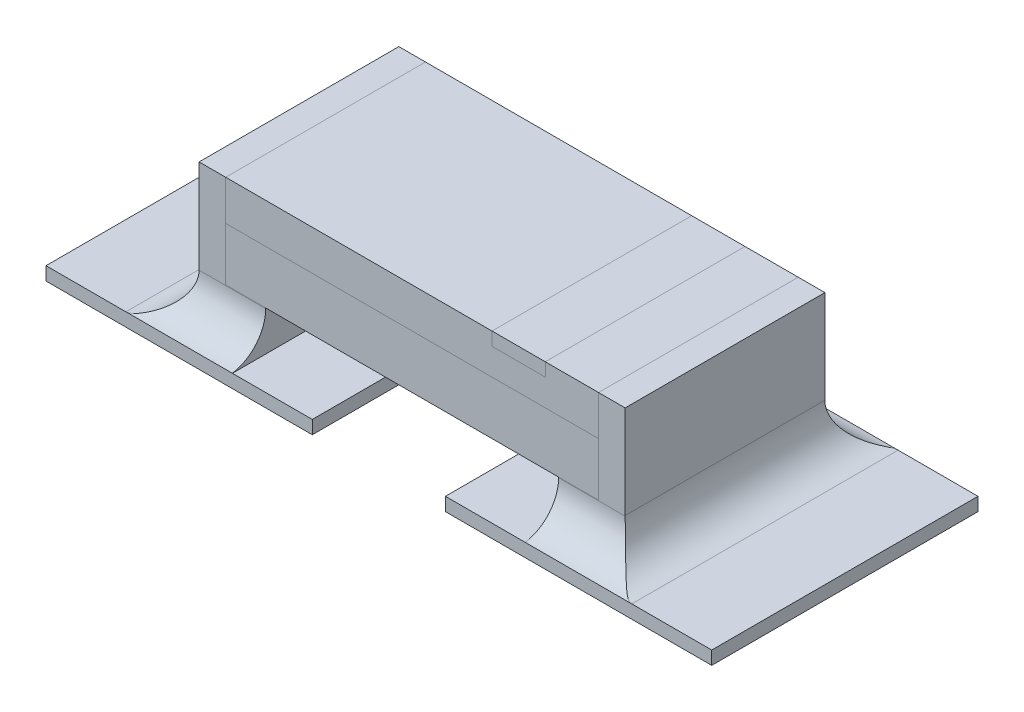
ISO-10303-21;
HEADER;
FILE_DESCRIPTION(('STEP AP214'),'2;1');
FILE_NAME('part.step','',(''),(''),'','','');
FILE_SCHEMA(('AUTOMOTIVE_DESIGN { 1 0 10303 214 1 1 1 1 }'));
ENDSEC;
DATA;
#1=APPLICATION_CONTEXT('core data for automotive mechanical design processes');
#2=APPLICATION_PROTOCOL_DEFINITION('international standard','automotive_design',2000,#1);
#3=PRODUCT_CONTEXT('',#1,'mechanical');
#4=PRODUCT('Part','Part','',(#3));
#5=PRODUCT_RELATED_PRODUCT_CATEGORY('part','',(#4));
#6=PRODUCT_DEFINITION_FORMATION('','',#4);
#7=PRODUCT_DEFINITION_CONTEXT('part definition',#1,'design');
#8=PRODUCT_DEFINITION('design','',#6,#7);
#9=PRODUCT_DEFINITION_SHAPE('','',#8);
#10=(LENGTH_UNIT() NAMED_UNIT(*) SI_UNIT(.MILLI.,.METRE.));
#11=(NAMED_UNIT(*) PLANE_ANGLE_UNIT() SI_UNIT($,.RADIAN.));
#12=(NAMED_UNIT(*) SI_UNIT($,.STERADIAN.) SOLID_ANGLE_UNIT());
#13=UNCERTAINTY_MEASURE_WITH_UNIT(LENGTH_MEASURE(1.E-05),#10,'distance_accuracy_value','');
#14=(GEOMETRIC_REPRESENTATION_CONTEXT(3) GLOBAL_UNCERTAINTY_ASSIGNED_CONTEXT((#13)) GLOBAL_UNIT_ASSIGNED_CONTEXT((#10,
#11,#12)) REPRESENTATION_CONTEXT('',''));
#15=CARTESIAN_POINT('',(0.,0.,0.));
#16=DIRECTION('',(0.,0.,1.));
#17=DIRECTION('',(1.,0.,0.));
#18=AXIS2_PLACEMENT_3D('',#15,#16,#17);
#19=CARTESIAN_POINT('',(0.6,1.1,-0.75));
#20=DIRECTION('',(1.,0.,0.));
#21=DIRECTION('',(0.,0.,-1.));
#22=AXIS2_PLACEMENT_3D('',#19,#20,#21);
#23=PLANE('',#22);
#24=DIRECTION('',(0.,0.,1.));
#25=VECTOR('',#24,1.);
#26=CARTESIAN_POINT('',(0.6,1.,-0.75));
#27=LINE('',#26,#25);
#28=CARTESIAN_POINT('',(0.6,1.,-0.75));
#29=VERTEX_POINT('',#28);
#30=CARTESIAN_POINT('',(0.6,1.,0.75));
#31=VERTEX_POINT('',#30);
#32=EDGE_CURVE('E106',#29,#31,#27,.T.);
#33=ORIENTED_EDGE('',*,*,#32,.T.);
#34=DIRECTION('',(0.,-1.,0.));
#35=VECTOR('',#34,1.);
#36=CARTESIAN_POINT('',(0.6,1.1,0.75));
#37=LINE('',#36,#35);
#38=CARTESIAN_POINT('',(0.6,1.1,0.75));
#39=VERTEX_POINT('',#38);
#40=EDGE_CURVE('E12',#39,#31,#37,.T.);
#41=ORIENTED_EDGE('',*,*,#40,.F.);
#42=DIRECTION('',(0.,0.,1.));
#43=VECTOR('',#42,1.);
#44=CARTESIAN_POINT('',(0.6,1.1,-0.75));
#45=LINE('',#44,#43);
#46=CARTESIAN_POINT('',(0.6,1.1,-0.75));
#47=VERTEX_POINT('',#46);
#48=EDGE_CURVE('E94',#47,#39,#45,.T.);
#49=ORIENTED_EDGE('',*,*,#48,.F.);
#50=DIRECTION('',(0.,-1.,0.));
#51=VECTOR('',#50,1.);
#52=CARTESIAN_POINT('',(0.6,1.1,-0.75));
#53=LINE('',#52,#51);
#54=EDGE_CURVE('E102',#47,#29,#53,.T.);
#55=ORIENTED_EDGE('',*,*,#54,.T.);
#56=EDGE_LOOP('',(#33,#41,#49,#55));
#57=FACE_BOUND('',#56,.T.);
#58=ADVANCED_FACE('F43',(#57),#23,.F.);
#59=CARTESIAN_POINT('',(0.6,1.1,0.75));
#60=DIRECTION('',(0.,0.,-1.));
#61=DIRECTION('',(-1.,0.,0.));
#62=AXIS2_PLACEMENT_3D('',#59,#60,#61);
#63=PLANE('',#62);
#64=DIRECTION('',(1.,0.,0.));
#65=VECTOR('',#64,1.);
#66=CARTESIAN_POINT('',(0.6,1.,0.75));
#67=LINE('',#66,#65);
#68=CARTESIAN_POINT('',(1.,1.,0.75));
#69=VERTEX_POINT('',#68);
#70=EDGE_CURVE('E98',#31,#69,#67,.T.);
#71=ORIENTED_EDGE('',*,*,#70,.T.);
#72=DIRECTION('',(0.,-1.,0.));
#73=VECTOR('',#72,1.);
#74=CARTESIAN_POINT('',(1.,1.1,0.75));
#75=LINE('',#74,#73);
#76=CARTESIAN_POINT('',(1.,1.1,0.75));
#77=VERTEX_POINT('',#76);
#78=EDGE_CURVE('E51',#77,#69,#75,.T.);
#79=ORIENTED_EDGE('',*,*,#78,.F.);
#80=DIRECTION('',(1.,0.,0.));
#81=VECTOR('',#80,1.);
#82=CARTESIAN_POINT('',(0.6,1.1,0.75));
#83=LINE('',#82,#81);
#84=EDGE_CURVE('E89',#39,#77,#83,.T.);
#85=ORIENTED_EDGE('',*,*,#84,.F.);
#86=ORIENTED_EDGE('',*,*,#40,.T.);
#87=EDGE_LOOP('',(#71,#79,#85,#86));
#88=FACE_BOUND('',#87,.T.);
#89=ADVANCED_FACE('F97',(#88),#63,.F.);
#90=CARTESIAN_POINT('',(1.,1.1,-0.75));
#91=DIRECTION('',(-1.,0.,0.));
#92=DIRECTION('',(0.,0.,1.));
#93=AXIS2_PLACEMENT_3D('',#90,#91,#92);
#94=PLANE('',#93);
#95=DIRECTION('',(0.,0.,-1.));
#96=VECTOR('',#95,1.);
#97=CARTESIAN_POINT('',(1.,1.,-0.75));
#98=LINE('',#97,#96);
#99=CARTESIAN_POINT('',(1.,1.,-0.75));
#100=VERTEX_POINT('',#99);
#101=EDGE_CURVE('E76',#69,#100,#98,.T.);
#102=ORIENTED_EDGE('',*,*,#101,.T.);
#103=DIRECTION('',(0.,-1.,0.));
#104=VECTOR('',#103,1.);
#105=CARTESIAN_POINT('',(1.,1.1,-0.75));
#106=LINE('',#105,#104);
#107=CARTESIAN_POINT('',(1.,1.1,-0.75));
#108=VERTEX_POINT('',#107);
#109=EDGE_CURVE('E99',#108,#100,#106,.T.);
#110=ORIENTED_EDGE('',*,*,#109,.F.);
#111=DIRECTION('',(0.,0.,-1.));
#112=VECTOR('',#111,1.);
#113=CARTESIAN_POINT('',(1.,1.1,-0.75));
#114=LINE('',#113,#112);
#115=EDGE_CURVE('E92',#77,#108,#114,.T.);
#116=ORIENTED_EDGE('',*,*,#115,.F.);
#117=ORIENTED_EDGE('',*,*,#78,.T.);
#118=EDGE_LOOP('',(#102,#110,#116,#117));
#119=FACE_BOUND('',#118,.T.);
#120=ADVANCED_FACE('F100',(#119),#94,.F.);
#121=CARTESIAN_POINT('',(0.6,1.1,-0.75));
#122=DIRECTION('',(0.,0.,1.));
#123=DIRECTION('',(1.,0.,0.));
#124=AXIS2_PLACEMENT_3D('',#121,#122,#123);
#125=PLANE('',#124);
#126=DIRECTION('',(-1.,0.,0.));
#127=VECTOR('',#126,1.);
#128=CARTESIAN_POINT('',(0.6,1.,-0.75));
#129=LINE('',#128,#127);
#130=EDGE_CURVE('E82',#100,#29,#129,.T.);
#131=ORIENTED_EDGE('',*,*,#130,.T.);
#132=ORIENTED_EDGE('',*,*,#54,.F.);
#133=DIRECTION('',(-1.,0.,0.));
#134=VECTOR('',#133,1.);
#135=CARTESIAN_POINT('',(0.6,1.1,-0.75));
#136=LINE('',#135,#134);
#137=EDGE_CURVE('E59',#108,#47,#136,.T.);
#138=ORIENTED_EDGE('',*,*,#137,.F.);
#139=ORIENTED_EDGE('',*,*,#109,.T.);
#140=EDGE_LOOP('',(#131,#132,#138,#139));
#141=FACE_BOUND('',#140,.T.);
#142=ADVANCED_FACE('F113',(#141),#125,.F.);
#143=CARTESIAN_POINT('',(0.,1.1,0.));
#144=DIRECTION('',(0.,1.,0.));
#145=DIRECTION('',(0.,0.,1.));
#146=AXIS2_PLACEMENT_3D('',#143,#144,#145);
#147=PLANE('',#146);
#148=ORIENTED_EDGE('',*,*,#48,.T.);
#149=ORIENTED_EDGE('',*,*,#84,.T.);
#150=ORIENTED_EDGE('',*,*,#115,.T.);
#151=ORIENTED_EDGE('',*,*,#137,.T.);
#152=EDGE_LOOP('',(#148,#149,#150,#151));
#153=FACE_BOUND('',#152,.T.);
#154=ADVANCED_FACE('F90',(#153),#147,.T.);
#155=CARTESIAN_POINT('',(0.,1.,0.));
#156=DIRECTION('',(0.,1.,0.));
#157=DIRECTION('',(0.,0.,1.));
#158=AXIS2_PLACEMENT_3D('',#155,#156,#157);
#159=PLANE('',#158);
#160=ORIENTED_EDGE('',*,*,#32,.F.);
#161=ORIENTED_EDGE('',*,*,#130,.F.);
#162=ORIENTED_EDGE('',*,*,#101,.F.);
#163=ORIENTED_EDGE('',*,*,#70,.F.);
#164=EDGE_LOOP('',(#160,#161,#162,#163));
#165=FACE_BOUND('',#164,.T.);
#166=ADVANCED_FACE('F116',(#165),#159,.F.);
#167=CLOSED_SHELL('',(#58,#89,#120,#142,#154,#166));
#168=MANIFOLD_SOLID_BREP('B2',#167);
#169=CARTESIAN_POINT('',(0.,1.1,0.));
#170=DIRECTION('',(0.,1.,0.));
#171=DIRECTION('',(0.,0.,1.));
#172=AXIS2_PLACEMENT_3D('',#169,#170,#171);
#173=PLANE('',#172);
#174=DIRECTION('',(0.,0.,-1.));
#175=VECTOR('',#174,1.);
#176=CARTESIAN_POINT('',(1.,1.1,-0.75));
#177=LINE('',#176,#175);
#178=CARTESIAN_POINT('',(1.,1.1,0.75));
#179=VERTEX_POINT('',#178);
#180=CARTESIAN_POINT('',(1.,1.1,-0.75));
#181=VERTEX_POINT('',#180);
#182=EDGE_CURVE('E256',#179,#181,#177,.T.);
#183=ORIENTED_EDGE('',*,*,#182,.F.);
#184=DIRECTION('',(1.,0.,0.));
#185=VECTOR('',#184,1.);
#186=CARTESIAN_POINT('',(-1.4,1.1,0.75));
#187=LINE('',#186,#185);
#188=CARTESIAN_POINT('',(1.4,1.1,0.75));
#189=VERTEX_POINT('',#188);
#190=EDGE_CURVE('E287',#179,#189,#187,.T.);
#191=ORIENTED_EDGE('',*,*,#190,.T.);
#192=DIRECTION('',(0.,0.,-1.));
#193=VECTOR('',#192,1.);
#194=CARTESIAN_POINT('',(1.4,1.1,-0.75));
#195=LINE('',#194,#193);
#196=CARTESIAN_POINT('',(1.4,1.1,-0.75));
#197=VERTEX_POINT('',#196);
#198=EDGE_CURVE('E289',#189,#197,#195,.T.);
#199=ORIENTED_EDGE('',*,*,#198,.T.);
#200=DIRECTION('',(-1.,0.,0.));
#201=VECTOR('',#200,1.);
#202=CARTESIAN_POINT('',(-1.4,1.1,-0.75));
#203=LINE('',#202,#201);
#204=EDGE_CURVE('E291',#197,#181,#203,.T.);
#205=ORIENTED_EDGE('',*,*,#204,.T.);
#206=EDGE_LOOP('',(#183,#191,#199,#205));
#207=FACE_BOUND('',#206,.T.);
#208=ADVANCED_FACE('F176',(#207),#173,.T.);
#209=CARTESIAN_POINT('',(-1.4,1.1,-0.75));
#210=DIRECTION('',(1.,0.,0.));
#211=DIRECTION('',(0.,0.,-1.));
#212=AXIS2_PLACEMENT_3D('',#209,#210,#211);
#213=PLANE('',#212);
#214=DIRECTION('',(0.,0.,1.));
#215=VECTOR('',#214,1.);
#216=CARTESIAN_POINT('',(-1.4,0.8,-0.75));
#217=LINE('',#216,#215);
#218=CARTESIAN_POINT('',(-1.4,0.8,-0.75));
#219=VERTEX_POINT('',#218);
#220=CARTESIAN_POINT('',(-1.4,0.8,0.75));
#221=VERTEX_POINT('',#220);
#222=EDGE_CURVE('E281',#219,#221,#217,.T.);
#223=ORIENTED_EDGE('',*,*,#222,.T.);
#224=DIRECTION('',(0.,-1.,0.));
#225=VECTOR('',#224,1.);
#226=CARTESIAN_POINT('',(-1.4,1.1,0.75));
#227=LINE('',#226,#225);
#228=CARTESIAN_POINT('',(-1.4,1.1,0.75));
#229=VERTEX_POINT('',#228);
#230=EDGE_CURVE('E41',#229,#221,#227,.T.);
#231=ORIENTED_EDGE('',*,*,#230,.F.);
#232=DIRECTION('',(0.,0.,1.));
#233=VECTOR('',#232,1.);
#234=CARTESIAN_POINT('',(-1.4,1.1,-0.75));
#235=LINE('',#234,#233);
#236=CARTESIAN_POINT('',(-1.4,1.1,-0.75));
#237=VERTEX_POINT('',#236);
#238=EDGE_CURVE('E285',#237,#229,#235,.T.);
#239=ORIENTED_EDGE('',*,*,#238,.F.);
#240=DIRECTION('',(0.,-1.,0.));
#241=VECTOR('',#240,1.);
#242=CARTESIAN_POINT('',(-1.4,1.1,-0.75));
#243=LINE('',#242,#241);
#244=EDGE_CURVE('E293',#237,#219,#243,.T.);
#245=ORIENTED_EDGE('',*,*,#244,.T.);
#246=EDGE_LOOP('',(#223,#231,#239,#245));
#247=FACE_BOUND('',#246,.T.);
#248=ADVANCED_FACE('F178',(#247),#213,.F.);
#249=CARTESIAN_POINT('',(-1.4,1.1,0.75));
#250=DIRECTION('',(0.,0.,-1.));
#251=DIRECTION('',(-1.,0.,0.));
#252=AXIS2_PLACEMENT_3D('',#249,#250,#251);
#253=PLANE('',#252);
#254=ORIENTED_EDGE('',*,*,#190,.F.);
#255=DIRECTION('',(0.,1.,0.));
#256=VECTOR('',#255,1.);
#257=CARTESIAN_POINT('',(1.,1.,0.75));
#258=LINE('',#257,#256);
#259=CARTESIAN_POINT('',(1.,1.,0.75));
#260=VERTEX_POINT('',#259);
#261=EDGE_CURVE('E279',#260,#179,#258,.T.);
#262=ORIENTED_EDGE('',*,*,#261,.F.);
#263=DIRECTION('',(1.,0.,0.));
#264=VECTOR('',#263,1.);
#265=CARTESIAN_POINT('',(1.,1.,0.75));
#266=LINE('',#265,#264);
#267=CARTESIAN_POINT('',(0.6,1.,0.75));
#268=VERTEX_POINT('',#267);
#269=EDGE_CURVE('E260',#268,#260,#266,.T.);
#270=ORIENTED_EDGE('',*,*,#269,.F.);
#271=DIRECTION('',(0.,1.,0.));
#272=VECTOR('',#271,1.);
#273=CARTESIAN_POINT('',(0.6,1.,0.75));
#274=LINE('',#273,#272);
#275=CARTESIAN_POINT('',(0.6,1.1,0.75));
#276=VERTEX_POINT('',#275);
#277=EDGE_CURVE('E282',#268,#276,#274,.T.);
#278=ORIENTED_EDGE('',*,*,#277,.T.);
#279=EDGE_CURVE('E228',#229,#276,#187,.T.);
#280=ORIENTED_EDGE('',*,*,#279,.F.);
#281=ORIENTED_EDGE('',*,*,#230,.T.);
#282=DIRECTION('',(1.,0.,0.));
#283=VECTOR('',#282,1.);
#284=CARTESIAN_POINT('',(-1.4,0.8,0.75));
#285=LINE('',#284,#283);
#286=CARTESIAN_POINT('',(1.4,0.8,0.75));
#287=VERTEX_POINT('',#286);
#288=EDGE_CURVE('E296',#221,#287,#285,.T.);
#289=ORIENTED_EDGE('',*,*,#288,.T.);
#290=DIRECTION('',(0.,-1.,0.));
#291=VECTOR('',#290,1.);
#292=CARTESIAN_POINT('',(1.4,1.1,0.75));
#293=LINE('',#292,#291);
#294=EDGE_CURVE('E184',#189,#287,#293,.T.);
#295=ORIENTED_EDGE('',*,*,#294,.F.);
#296=EDGE_LOOP('',(#254,#262,#270,#278,#280,#281,#289,#295));
#297=FACE_BOUND('',#296,.T.);
#298=ADVANCED_FACE('F319',(#297),#253,.F.);
#299=CARTESIAN_POINT('',(1.4,1.1,-0.75));
#300=DIRECTION('',(-1.,0.,0.));
#301=DIRECTION('',(0.,0.,1.));
#302=AXIS2_PLACEMENT_3D('',#299,#300,#301);
#303=PLANE('',#302);
#304=DIRECTION('',(0.,0.,-1.));
#305=VECTOR('',#304,1.);
#306=CARTESIAN_POINT('',(1.4,0.8,-0.75));
#307=LINE('',#306,#305);
#308=CARTESIAN_POINT('',(1.4,0.8,-0.75));
#309=VERTEX_POINT('',#308);
#310=EDGE_CURVE('E298',#287,#309,#307,.T.);
#311=ORIENTED_EDGE('',*,*,#310,.T.);
#312=DIRECTION('',(0.,-1.,0.));
#313=VECTOR('',#312,1.);
#314=CARTESIAN_POINT('',(1.4,1.1,-0.75));
#315=LINE('',#314,#313);
#316=EDGE_CURVE('E302',#197,#309,#315,.T.);
#317=ORIENTED_EDGE('',*,*,#316,.F.);
#318=ORIENTED_EDGE('',*,*,#198,.F.);
#319=ORIENTED_EDGE('',*,*,#294,.T.);
#320=EDGE_LOOP('',(#311,#317,#318,#319));
#321=FACE_BOUND('',#320,.T.);
#322=ADVANCED_FACE('F308',(#321),#303,.F.);
#323=CARTESIAN_POINT('',(-1.4,1.1,-0.75));
#324=DIRECTION('',(0.,0.,1.));
#325=DIRECTION('',(1.,0.,0.));
#326=AXIS2_PLACEMENT_3D('',#323,#324,#325);
#327=PLANE('',#326);
#328=DIRECTION('',(-1.,0.,0.));
#329=VECTOR('',#328,1.);
#330=CARTESIAN_POINT('',(1.,1.,-0.75));
#331=LINE('',#330,#329);
#332=CARTESIAN_POINT('',(1.,1.,-0.75));
#333=VERTEX_POINT('',#332);
#334=CARTESIAN_POINT('',(0.6,1.,-0.75));
#335=VERTEX_POINT('',#334);
#336=EDGE_CURVE('E266',#333,#335,#331,.T.);
#337=ORIENTED_EDGE('',*,*,#336,.F.);
#338=DIRECTION('',(0.,1.,0.));
#339=VECTOR('',#338,1.);
#340=CARTESIAN_POINT('',(1.,1.,-0.75));
#341=LINE('',#340,#339);
#342=EDGE_CURVE('E250',#333,#181,#341,.T.);
#343=ORIENTED_EDGE('',*,*,#342,.T.);
#344=ORIENTED_EDGE('',*,*,#204,.F.);
#345=ORIENTED_EDGE('',*,*,#316,.T.);
#346=DIRECTION('',(-1.,0.,0.));
#347=VECTOR('',#346,1.);
#348=CARTESIAN_POINT('',(-1.4,0.8,-0.75));
#349=LINE('',#348,#347);
#350=EDGE_CURVE('E221',#309,#219,#349,.T.);
#351=ORIENTED_EDGE('',*,*,#350,.T.);
#352=ORIENTED_EDGE('',*,*,#244,.F.);
#353=CARTESIAN_POINT('',(0.6,1.1,-0.75));
#354=VERTEX_POINT('',#353);
#355=EDGE_CURVE('E199',#354,#237,#203,.T.);
#356=ORIENTED_EDGE('',*,*,#355,.F.);
#357=DIRECTION('',(0.,1.,0.));
#358=VECTOR('',#357,1.);
#359=CARTESIAN_POINT('',(0.6,1.,-0.75));
#360=LINE('',#359,#358);
#361=EDGE_CURVE('E191',#335,#354,#360,.T.);
#362=ORIENTED_EDGE('',*,*,#361,.F.);
#363=EDGE_LOOP('',(#337,#343,#344,#345,#351,#352,#356,#362));
#364=FACE_BOUND('',#363,.T.);
#365=ADVANCED_FACE('F271',(#364),#327,.F.);
#366=DIRECTION('',(0.,0.,1.));
#367=VECTOR('',#366,1.);
#368=CARTESIAN_POINT('',(0.6,1.1,-0.75));
#369=LINE('',#368,#367);
#370=EDGE_CURVE('E269',#354,#276,#369,.T.);
#371=ORIENTED_EDGE('',*,*,#370,.F.);
#372=ORIENTED_EDGE('',*,*,#355,.T.);
#373=ORIENTED_EDGE('',*,*,#238,.T.);
#374=ORIENTED_EDGE('',*,*,#279,.T.);
#375=EDGE_LOOP('',(#371,#372,#373,#374));
#376=FACE_BOUND('',#375,.T.);
#377=ADVANCED_FACE('F317',(#376),#173,.T.);
#378=CARTESIAN_POINT('',(0.,0.8,0.));
#379=DIRECTION('',(0.,1.,0.));
#380=DIRECTION('',(0.,0.,1.));
#381=AXIS2_PLACEMENT_3D('',#378,#379,#380);
#382=PLANE('',#381);
#383=ORIENTED_EDGE('',*,*,#222,.F.);
#384=ORIENTED_EDGE('',*,*,#350,.F.);
#385=ORIENTED_EDGE('',*,*,#310,.F.);
#386=ORIENTED_EDGE('',*,*,#288,.F.);
#387=EDGE_LOOP('',(#383,#384,#385,#386));
#388=FACE_BOUND('',#387,.T.);
#389=ADVANCED_FACE('F313',(#388),#382,.F.);
#390=CARTESIAN_POINT('',(1.,1.,-0.75));
#391=DIRECTION('',(1.,0.,0.));
#392=DIRECTION('',(0.,0.,-1.));
#393=AXIS2_PLACEMENT_3D('',#390,#391,#392);
#394=PLANE('',#393);
#395=ORIENTED_EDGE('',*,*,#182,.T.);
#396=ORIENTED_EDGE('',*,*,#342,.F.);
#397=DIRECTION('',(0.,0.,-1.));
#398=VECTOR('',#397,1.);
#399=CARTESIAN_POINT('',(1.,1.,-0.75));
#400=LINE('',#399,#398);
#401=EDGE_CURVE('E253',#260,#333,#400,.T.);
#402=ORIENTED_EDGE('',*,*,#401,.F.);
#403=ORIENTED_EDGE('',*,*,#261,.T.);
#404=EDGE_LOOP('',(#395,#396,#402,#403));
#405=FACE_BOUND('',#404,.T.);
#406=ADVANCED_FACE('F252',(#405),#394,.F.);
#407=CARTESIAN_POINT('',(0.6,1.,-0.75));
#408=DIRECTION('',(-1.,0.,0.));
#409=DIRECTION('',(0.,0.,1.));
#410=AXIS2_PLACEMENT_3D('',#407,#408,#409);
#411=PLANE('',#410);
#412=ORIENTED_EDGE('',*,*,#370,.T.);
#413=ORIENTED_EDGE('',*,*,#277,.F.);
#414=DIRECTION('',(0.,0.,1.));
#415=VECTOR('',#414,1.);
#416=CARTESIAN_POINT('',(0.6,1.,-0.75));
#417=LINE('',#416,#415);
#418=EDGE_CURVE('E272',#335,#268,#417,.T.);
#419=ORIENTED_EDGE('',*,*,#418,.F.);
#420=ORIENTED_EDGE('',*,*,#361,.T.);
#421=EDGE_LOOP('',(#412,#413,#419,#420));
#422=FACE_BOUND('',#421,.T.);
#423=ADVANCED_FACE('F318',(#422),#411,.F.);
#424=CARTESIAN_POINT('',(0.,1.,0.));
#425=DIRECTION('',(0.,-1.,0.));
#426=DIRECTION('',(0.,0.,-1.));
#427=AXIS2_PLACEMENT_3D('',#424,#425,#426);
#428=PLANE('',#427);
#429=ORIENTED_EDGE('',*,*,#401,.T.);
#430=ORIENTED_EDGE('',*,*,#336,.T.);
#431=ORIENTED_EDGE('',*,*,#418,.T.);
#432=ORIENTED_EDGE('',*,*,#269,.T.);
#433=EDGE_LOOP('',(#429,#430,#431,#432));
#434=FACE_BOUND('',#433,.T.);
#435=ADVANCED_FACE('F264',(#434),#428,.F.);
#436=CLOSED_SHELL('',(#208,#248,#298,#322,#365,#377,#389,#406,#423,#435));
#437=MANIFOLD_SOLID_BREP('B6',#436);
#438=CARTESIAN_POINT('',(-1.4,0.8,-0.75));
#439=DIRECTION('',(1.,0.,0.));
#440=DIRECTION('',(0.,0.,-1.));
#441=AXIS2_PLACEMENT_3D('',#438,#439,#440);
#442=PLANE('',#441);
#443=DIRECTION('',(0.,0.,1.));
#444=VECTOR('',#443,1.);
#445=CARTESIAN_POINT('',(-1.4,0.4,-0.75));
#446=LINE('',#445,#444);
#447=CARTESIAN_POINT('',(-1.4,0.4,-0.75));
#448=VERTEX_POINT('',#447);
#449=CARTESIAN_POINT('',(-1.4,0.4,0.75));
#450=VERTEX_POINT('',#449);
#451=EDGE_CURVE('E473',#448,#450,#446,.T.);
#452=ORIENTED_EDGE('',*,*,#451,.T.);
#453=DIRECTION('',(0.,-1.,0.));
#454=VECTOR('',#453,1.);
#455=CARTESIAN_POINT('',(-1.4,0.8,0.75));
#456=LINE('',#455,#454);
#457=CARTESIAN_POINT('',(-1.4,0.8,0.75));
#458=VERTEX_POINT('',#457);
#459=EDGE_CURVE('E174',#458,#450,#456,.T.);
#460=ORIENTED_EDGE('',*,*,#459,.F.);
#461=DIRECTION('',(0.,0.,1.));
#462=VECTOR('',#461,1.);
#463=CARTESIAN_POINT('',(-1.4,0.8,-0.75));
#464=LINE('',#463,#462);
#465=CARTESIAN_POINT('',(-1.4,0.8,-0.75));
#466=VERTEX_POINT('',#465);
#467=EDGE_CURVE('E461',#466,#458,#464,.T.);
#468=ORIENTED_EDGE('',*,*,#467,.F.);
#469=DIRECTION('',(0.,-1.,0.));
#470=VECTOR('',#469,1.);
#471=CARTESIAN_POINT('',(-1.4,0.8,-0.75));
#472=LINE('',#471,#470);
#473=EDGE_CURVE('E469',#466,#448,#472,.T.);
#474=ORIENTED_EDGE('',*,*,#473,.T.);
#475=EDGE_LOOP('',(#452,#460,#468,#474));
#476=FACE_BOUND('',#475,.T.);
#477=ADVANCED_FACE('F410',(#476),#442,.F.);
#478=CARTESIAN_POINT('',(-1.4,0.8,0.75));
#479=DIRECTION('',(0.,0.,-1.));
#480=DIRECTION('',(-1.,0.,0.));
#481=AXIS2_PLACEMENT_3D('',#478,#479,#480);
#482=PLANE('',#481);
#483=DIRECTION('',(1.,0.,0.));
#484=VECTOR('',#483,1.);
#485=CARTESIAN_POINT('',(-1.4,0.4,0.75));
#486=LINE('',#485,#484);
#487=CARTESIAN_POINT('',(1.4,0.4,0.75));
#488=VERTEX_POINT('',#487);
#489=EDGE_CURVE('E465',#450,#488,#486,.T.);
#490=ORIENTED_EDGE('',*,*,#489,.T.);
#491=DIRECTION('',(0.,-1.,0.));
#492=VECTOR('',#491,1.);
#493=CARTESIAN_POINT('',(1.4,0.8,0.75));
#494=LINE('',#493,#492);
#495=CARTESIAN_POINT('',(1.4,0.8,0.75));
#496=VERTEX_POINT('',#495);
#497=EDGE_CURVE('E418',#496,#488,#494,.T.);
#498=ORIENTED_EDGE('',*,*,#497,.F.);
#499=DIRECTION('',(1.,0.,0.));
#500=VECTOR('',#499,1.);
#501=CARTESIAN_POINT('',(-1.4,0.8,0.75));
#502=LINE('',#501,#500);
#503=EDGE_CURVE('E456',#458,#496,#502,.T.);
#504=ORIENTED_EDGE('',*,*,#503,.F.);
#505=ORIENTED_EDGE('',*,*,#459,.T.);
#506=EDGE_LOOP('',(#490,#498,#504,#505));
#507=FACE_BOUND('',#506,.T.);
#508=ADVANCED_FACE('F464',(#507),#482,.F.);
#509=CARTESIAN_POINT('',(1.4,0.8,-0.75));
#510=DIRECTION('',(-1.,0.,0.));
#511=DIRECTION('',(0.,0.,1.));
#512=AXIS2_PLACEMENT_3D('',#509,#510,#511);
#513=PLANE('',#512);
#514=DIRECTION('',(0.,0.,-1.));
#515=VECTOR('',#514,1.);
#516=CARTESIAN_POINT('',(1.4,0.4,-0.75));
#517=LINE('',#516,#515);
#518=CARTESIAN_POINT('',(1.4,0.4,-0.75));
#519=VERTEX_POINT('',#518);
#520=EDGE_CURVE('E443',#488,#519,#517,.T.);
#521=ORIENTED_EDGE('',*,*,#520,.T.);
#522=DIRECTION('',(0.,-1.,0.));
#523=VECTOR('',#522,1.);
#524=CARTESIAN_POINT('',(1.4,0.8,-0.75));
#525=LINE('',#524,#523);
#526=CARTESIAN_POINT('',(1.4,0.8,-0.75));
#527=VERTEX_POINT('',#526);
#528=EDGE_CURVE('E466',#527,#519,#525,.T.);
#529=ORIENTED_EDGE('',*,*,#528,.F.);
#530=DIRECTION('',(0.,0.,-1.));
#531=VECTOR('',#530,1.);
#532=CARTESIAN_POINT('',(1.4,0.8,-0.75));
#533=LINE('',#532,#531);
#534=EDGE_CURVE('E459',#496,#527,#533,.T.);
#535=ORIENTED_EDGE('',*,*,#534,.F.);
#536=ORIENTED_EDGE('',*,*,#497,.T.);
#537=EDGE_LOOP('',(#521,#529,#535,#536));
#538=FACE_BOUND('',#537,.T.);
#539=ADVANCED_FACE('F467',(#538),#513,.F.);
#540=CARTESIAN_POINT('',(-1.4,0.8,-0.75));
#541=DIRECTION('',(0.,0.,1.));
#542=DIRECTION('',(1.,0.,0.));
#543=AXIS2_PLACEMENT_3D('',#540,#541,#542);
#544=PLANE('',#543);
#545=DIRECTION('',(-1.,0.,0.));
#546=VECTOR('',#545,1.);
#547=CARTESIAN_POINT('',(-1.4,0.4,-0.75));
#548=LINE('',#547,#546);
#549=EDGE_CURVE('E449',#519,#448,#548,.T.);
#550=ORIENTED_EDGE('',*,*,#549,.T.);
#551=ORIENTED_EDGE('',*,*,#473,.F.);
#552=DIRECTION('',(-1.,0.,0.));
#553=VECTOR('',#552,1.);
#554=CARTESIAN_POINT('',(-1.4,0.8,-0.75));
#555=LINE('',#554,#553);
#556=EDGE_CURVE('E426',#527,#466,#555,.T.);
#557=ORIENTED_EDGE('',*,*,#556,.F.);
#558=ORIENTED_EDGE('',*,*,#528,.T.);
#559=EDGE_LOOP('',(#550,#551,#557,#558));
#560=FACE_BOUND('',#559,.T.);
#561=ADVANCED_FACE('F480',(#560),#544,.F.);
#562=CARTESIAN_POINT('',(0.,0.8,0.));
#563=DIRECTION('',(0.,1.,0.));
#564=DIRECTION('',(0.,0.,1.));
#565=AXIS2_PLACEMENT_3D('',#562,#563,#564);
#566=PLANE('',#565);
#567=ORIENTED_EDGE('',*,*,#467,.T.);
#568=ORIENTED_EDGE('',*,*,#503,.T.);
#569=ORIENTED_EDGE('',*,*,#534,.T.);
#570=ORIENTED_EDGE('',*,*,#556,.T.);
#571=EDGE_LOOP('',(#567,#568,#569,#570));
#572=FACE_BOUND('',#571,.T.);
#573=ADVANCED_FACE('F457',(#572),#566,.T.);
#574=CARTESIAN_POINT('',(0.,0.4,0.));
#575=DIRECTION('',(0.,1.,0.));
#576=DIRECTION('',(0.,0.,1.));
#577=AXIS2_PLACEMENT_3D('',#574,#575,#576);
#578=PLANE('',#577);
#579=ORIENTED_EDGE('',*,*,#451,.F.);
#580=ORIENTED_EDGE('',*,*,#549,.F.);
#581=ORIENTED_EDGE('',*,*,#520,.F.);
#582=ORIENTED_EDGE('',*,*,#489,.F.);
#583=EDGE_LOOP('',(#579,#580,#581,#582));
#584=FACE_BOUND('',#583,.T.);
#585=ADVANCED_FACE('F483',(#584),#578,.F.);
#586=CLOSED_SHELL('',(#477,#508,#539,#561,#573,#585));
#587=MANIFOLD_SOLID_BREP('B35',#586);
#588=CARTESIAN_POINT('',(0.,0.1,0.));
#589=DIRECTION('',(0.,1.,0.));
#590=DIRECTION('',(0.,0.,1.));
#591=AXIS2_PLACEMENT_3D('',#588,#589,#590);
#592=PLANE('',#591);
#593=DIRECTION('',(0.,0.,1.));
#594=VECTOR('',#593,1.);
#595=CARTESIAN_POINT('',(1.1,0.1,-0.75));
#596=LINE('',#595,#594);
#597=CARTESIAN_POINT('',(1.1,0.1,-1.));
#598=VERTEX_POINT('',#597);
#599=CARTESIAN_POINT('',(1.1,0.1,1.));
#600=VERTEX_POINT('',#599);
#601=EDGE_CURVE('E673',#598,#600,#596,.T.);
#602=ORIENTED_EDGE('',*,*,#601,.F.);
#603=DIRECTION('',(-1.,0.,0.));
#604=VECTOR('',#603,1.);
#605=CARTESIAN_POINT('',(0.5,0.1,-1.));
#606=LINE('',#605,#604);
#607=CARTESIAN_POINT('',(0.5,0.1,-1.));
#608=VERTEX_POINT('',#607);
#609=EDGE_CURVE('E706',#598,#608,#606,.T.);
#610=ORIENTED_EDGE('',*,*,#609,.T.);
#611=DIRECTION('',(0.,0.,1.));
#612=VECTOR('',#611,1.);
#613=CARTESIAN_POINT('',(0.5,0.1,-1.));
#614=LINE('',#613,#612);
#615=CARTESIAN_POINT('',(0.5,0.1,1.));
#616=VERTEX_POINT('',#615);
#617=EDGE_CURVE('E695',#608,#616,#614,.T.);
#618=ORIENTED_EDGE('',*,*,#617,.T.);
#619=DIRECTION('',(1.,0.,0.));
#620=VECTOR('',#619,1.);
#621=CARTESIAN_POINT('',(0.5,0.1,1.));
#622=LINE('',#621,#620);
#623=EDGE_CURVE('E700',#616,#600,#622,.T.);
#624=ORIENTED_EDGE('',*,*,#623,.T.);
#625=EDGE_LOOP('',(#602,#610,#618,#624));
#626=FACE_BOUND('',#625,.T.);
#627=ADVANCED_FACE('F542',(#626),#592,.T.);
#628=CARTESIAN_POINT('',(2.5,0.1,-0.999999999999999));
#629=VERTEX_POINT('',#628);
#630=CARTESIAN_POINT('',(1.9,0.1,-1.));
#631=VERTEX_POINT('',#630);
#632=EDGE_CURVE('E707',#629,#631,#606,.T.);
#633=ORIENTED_EDGE('',*,*,#632,.T.);
#634=DIRECTION('',(0.,0.,-1.));
#635=VECTOR('',#634,1.);
#636=CARTESIAN_POINT('',(1.9,0.1,0.));
#637=LINE('',#636,#635);
#638=CARTESIAN_POINT('',(1.9,0.1,1.));
#639=VERTEX_POINT('',#638);
#640=EDGE_CURVE('E731',#631,#639,#637,.F.);
#641=ORIENTED_EDGE('',*,*,#640,.T.);
#642=CARTESIAN_POINT('',(2.5,0.1,0.999999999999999));
#643=VERTEX_POINT('',#642);
#644=EDGE_CURVE('E698',#639,#643,#622,.T.);
#645=ORIENTED_EDGE('',*,*,#644,.T.);
#646=DIRECTION('',(0.,0.,-1.));
#647=VECTOR('',#646,1.);
#648=CARTESIAN_POINT('',(2.5,0.1,-0.999999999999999));
#649=LINE('',#648,#647);
#650=EDGE_CURVE('E703',#643,#629,#649,.T.);
#651=ORIENTED_EDGE('',*,*,#650,.T.);
#652=EDGE_LOOP('',(#633,#641,#645,#651));
#653=FACE_BOUND('',#652,.T.);
#654=ADVANCED_FACE('F756',(#653),#592,.T.);
#655=CARTESIAN_POINT('',(1.4,1.1,-0.75));
#656=DIRECTION('',(1.,0.,0.));
#657=DIRECTION('',(0.,0.,-1.));
#658=AXIS2_PLACEMENT_3D('',#655,#656,#657);
#659=PLANE('',#658);
#660=DIRECTION('',(0.,0.,-1.));
#661=VECTOR('',#660,1.);
#662=CARTESIAN_POINT('',(1.4,0.4,-0.75));
#663=LINE('',#662,#661);
#664=CARTESIAN_POINT('',(1.4,0.4,0.75));
#665=VERTEX_POINT('',#664);
#666=CARTESIAN_POINT('',(1.4,0.4,-0.75));
#667=VERTEX_POINT('',#666);
#668=EDGE_CURVE('E653',#665,#667,#663,.T.);
#669=ORIENTED_EDGE('',*,*,#668,.F.);
#670=DIRECTION('',(0.,-1.,0.));
#671=VECTOR('',#670,1.);
#672=CARTESIAN_POINT('',(1.4,1.1,0.75));
#673=LINE('',#672,#671);
#674=CARTESIAN_POINT('',(1.4,1.1,0.75));
#675=VERTEX_POINT('',#674);
#676=EDGE_CURVE('E691',#675,#665,#673,.T.);
#677=ORIENTED_EDGE('',*,*,#676,.F.);
#678=DIRECTION('',(0.,0.,1.));
#679=VECTOR('',#678,1.);
#680=CARTESIAN_POINT('',(1.4,1.1,-0.75));
#681=LINE('',#680,#679);
#682=CARTESIAN_POINT('',(1.4,1.1,-0.75));
#683=VERTEX_POINT('',#682);
#684=EDGE_CURVE('E663',#683,#675,#681,.T.);
#685=ORIENTED_EDGE('',*,*,#684,.F.);
#686=DIRECTION('',(0.,-1.,0.));
#687=VECTOR('',#686,1.);
#688=CARTESIAN_POINT('',(1.4,1.1,-0.75));
#689=LINE('',#688,#687);
#690=EDGE_CURVE('E684',#683,#667,#689,.T.);
#691=ORIENTED_EDGE('',*,*,#690,.T.);
#692=EDGE_LOOP('',(#669,#677,#685,#691));
#693=FACE_BOUND('',#692,.T.);
#694=ADVANCED_FACE('F762',(#693),#659,.F.);
#695=CARTESIAN_POINT('',(0.5,0.1,-1.));
#696=DIRECTION('',(1.,0.,0.));
#697=DIRECTION('',(0.,0.,-1.));
#698=AXIS2_PLACEMENT_3D('',#695,#696,#697);
#699=PLANE('',#698);
#700=DIRECTION('',(0.,0.,1.));
#701=VECTOR('',#700,1.);
#702=CARTESIAN_POINT('',(0.5,0.,-1.));
#703=LINE('',#702,#701);
#704=CARTESIAN_POINT('',(0.5,0.,-1.));
#705=VERTEX_POINT('',#704);
#706=CARTESIAN_POINT('',(0.5,0.,1.));
#707=VERTEX_POINT('',#706);
#708=EDGE_CURVE('E694',#705,#707,#703,.T.);
#709=ORIENTED_EDGE('',*,*,#708,.T.);
#710=DIRECTION('',(0.,-1.,0.));
#711=VECTOR('',#710,1.);
#712=CARTESIAN_POINT('',(0.5,0.1,1.));
#713=LINE('',#712,#711);
#714=EDGE_CURVE('E727',#616,#707,#713,.T.);
#715=ORIENTED_EDGE('',*,*,#714,.F.);
#716=ORIENTED_EDGE('',*,*,#617,.F.);
#717=DIRECTION('',(0.,-1.,0.));
#718=VECTOR('',#717,1.);
#719=CARTESIAN_POINT('',(0.5,0.1,-1.));
#720=LINE('',#719,#718);
#721=EDGE_CURVE('E710',#608,#705,#720,.T.);
#722=ORIENTED_EDGE('',*,*,#721,.T.);
#723=EDGE_LOOP('',(#709,#715,#716,#722));
#724=FACE_BOUND('',#723,.T.);
#725=ADVANCED_FACE('F782',(#724),#699,.F.);
#726=CARTESIAN_POINT('',(0.5,0.1,1.));
#727=DIRECTION('',(0.,0.,-1.));
#728=DIRECTION('',(-1.,0.,0.));
#729=AXIS2_PLACEMENT_3D('',#726,#727,#728);
#730=PLANE('',#729);
#731=DIRECTION('',(1.,0.,0.));
#732=VECTOR('',#731,1.);
#733=CARTESIAN_POINT('',(0.5,0.,1.));
#734=LINE('',#733,#732);
#735=CARTESIAN_POINT('',(2.5,0.,0.999999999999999));
#736=VERTEX_POINT('',#735);
#737=EDGE_CURVE('E714',#707,#736,#734,.T.);
#738=ORIENTED_EDGE('',*,*,#737,.T.);
#739=DIRECTION('',(0.,-1.,0.));
#740=VECTOR('',#739,1.);
#741=CARTESIAN_POINT('',(2.5,0.1,0.999999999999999));
#742=LINE('',#741,#740);
#743=EDGE_CURVE('E724',#643,#736,#742,.T.);
#744=ORIENTED_EDGE('',*,*,#743,.F.);
#745=ORIENTED_EDGE('',*,*,#644,.F.);
#746=EDGE_CURVE('E704',#600,#639,#622,.T.);
#747=ORIENTED_EDGE('',*,*,#746,.F.);
#748=ORIENTED_EDGE('',*,*,#623,.F.);
#749=ORIENTED_EDGE('',*,*,#714,.T.);
#750=EDGE_LOOP('',(#738,#744,#745,#747,#748,#749));
#751=FACE_BOUND('',#750,.T.);
#752=ADVANCED_FACE('F779',(#751),#730,.F.);
#753=CARTESIAN_POINT('',(2.5,0.1,-0.999999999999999));
#754=DIRECTION('',(-1.,0.,0.));
#755=DIRECTION('',(0.,0.,1.));
#756=AXIS2_PLACEMENT_3D('',#753,#754,#755);
#757=PLANE('',#756);
#758=DIRECTION('',(0.,0.,-1.));
#759=VECTOR('',#758,1.);
#760=CARTESIAN_POINT('',(2.5,0.,-0.999999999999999));
#761=LINE('',#760,#759);
#762=CARTESIAN_POINT('',(2.5,0.,-0.999999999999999));
#763=VERTEX_POINT('',#762);
#764=EDGE_CURVE('E716',#736,#763,#761,.T.);
#765=ORIENTED_EDGE('',*,*,#764,.T.);
#766=DIRECTION('',(0.,-1.,0.));
#767=VECTOR('',#766,1.);
#768=CARTESIAN_POINT('',(2.5,0.1,-0.999999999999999));
#769=LINE('',#768,#767);
#770=EDGE_CURVE('E721',#629,#763,#769,.T.);
#771=ORIENTED_EDGE('',*,*,#770,.F.);
#772=ORIENTED_EDGE('',*,*,#650,.F.);
#773=ORIENTED_EDGE('',*,*,#743,.T.);
#774=EDGE_LOOP('',(#765,#771,#772,#773));
#775=FACE_BOUND('',#774,.T.);
#776=ADVANCED_FACE('F775',(#775),#757,.F.);
#777=CARTESIAN_POINT('',(0.5,0.1,-1.));
#778=DIRECTION('',(0.,0.,1.));
#779=DIRECTION('',(1.,0.,0.));
#780=AXIS2_PLACEMENT_3D('',#777,#778,#779);
#781=PLANE('',#780);
#782=DIRECTION('',(-1.,0.,0.));
#783=VECTOR('',#782,1.);
#784=CARTESIAN_POINT('',(0.5,0.,-1.));
#785=LINE('',#784,#783);
#786=EDGE_CURVE('E699',#763,#705,#785,.T.);
#787=ORIENTED_EDGE('',*,*,#786,.T.);
#788=ORIENTED_EDGE('',*,*,#721,.F.);
#789=ORIENTED_EDGE('',*,*,#609,.F.);
#790=EDGE_CURVE('E711',#631,#598,#606,.T.);
#791=ORIENTED_EDGE('',*,*,#790,.F.);
#792=ORIENTED_EDGE('',*,*,#632,.F.);
#793=ORIENTED_EDGE('',*,*,#770,.T.);
#794=EDGE_LOOP('',(#787,#788,#789,#791,#792,#793));
#795=FACE_BOUND('',#794,.T.);
#796=ADVANCED_FACE('F771',(#795),#781,.F.);
#797=CARTESIAN_POINT('',(0.,0.,0.));
#798=DIRECTION('',(0.,1.,0.));
#799=DIRECTION('',(0.,0.,1.));
#800=AXIS2_PLACEMENT_3D('',#797,#798,#799);
#801=PLANE('',#800);
#802=ORIENTED_EDGE('',*,*,#708,.F.);
#803=ORIENTED_EDGE('',*,*,#786,.F.);
#804=ORIENTED_EDGE('',*,*,#764,.F.);
#805=ORIENTED_EDGE('',*,*,#737,.F.);
#806=EDGE_LOOP('',(#802,#803,#804,#805));
#807=FACE_BOUND('',#806,.T.);
#808=ADVANCED_FACE('F767',(#807),#801,.F.);
#809=CARTESIAN_POINT('',(1.4,1.1,0.75));
#810=DIRECTION('',(0.,0.,-1.));
#811=DIRECTION('',(-1.,0.,0.));
#812=AXIS2_PLACEMENT_3D('',#809,#810,#811);
#813=PLANE('',#812);
#814=DIRECTION('',(0.,-1.,0.));
#815=VECTOR('',#814,1.);
#816=CARTESIAN_POINT('',(1.1,0.4,0.75));
#817=LINE('',#816,#815);
#818=CARTESIAN_POINT('',(1.1,0.4,0.75));
#819=VERTEX_POINT('',#818);
#820=CARTESIAN_POINT('',(1.1,0.395803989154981,0.75));
#821=VERTEX_POINT('',#820);
#822=EDGE_CURVE('E664',#819,#821,#817,.T.);
#823=ORIENTED_EDGE('',*,*,#822,.T.);
#824=DIRECTION('',(-1.,0.,0.));
#825=VECTOR('',#824,1.);
#826=CARTESIAN_POINT('',(1.4,0.395803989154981,0.75));
#827=LINE('',#826,#825);
#828=CARTESIAN_POINT('',(1.60002934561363,0.395803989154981,0.75));
#829=VERTEX_POINT('',#828);
#830=EDGE_CURVE('E565',#821,#829,#827,.F.);
#831=ORIENTED_EDGE('',*,*,#830,.T.);
#832=CARTESIAN_POINT('',(1.9,0.4,0.75));
#833=DIRECTION('',(0.,0.,-1.));
#834=DIRECTION('',(-1.,0.,0.));
#835=AXIS2_PLACEMENT_3D('',#832,#833,#834);
#836=CIRCLE('',#835,0.3);
#837=CARTESIAN_POINT('',(1.6,0.4,0.75));
#838=VERTEX_POINT('',#837);
#839=EDGE_CURVE('E557',#829,#838,#836,.T.);
#840=ORIENTED_EDGE('',*,*,#839,.T.);
#841=DIRECTION('',(0.,-1.,0.));
#842=VECTOR('',#841,1.);
#843=CARTESIAN_POINT('',(1.6,1.1,0.75));
#844=LINE('',#843,#842);
#845=CARTESIAN_POINT('',(1.6,1.1,0.75));
#846=VERTEX_POINT('',#845);
#847=EDGE_CURVE('E688',#846,#838,#844,.T.);
#848=ORIENTED_EDGE('',*,*,#847,.F.);
#849=DIRECTION('',(1.,0.,0.));
#850=VECTOR('',#849,1.);
#851=CARTESIAN_POINT('',(1.4,1.1,0.75));
#852=LINE('',#851,#850);
#853=EDGE_CURVE('E678',#675,#846,#852,.T.);
#854=ORIENTED_EDGE('',*,*,#853,.F.);
#855=ORIENTED_EDGE('',*,*,#676,.T.);
#856=DIRECTION('',(1.,0.,0.));
#857=VECTOR('',#856,1.);
#858=CARTESIAN_POINT('',(1.4,0.4,0.75));
#859=LINE('',#858,#857);
#860=EDGE_CURVE('E668',#819,#665,#859,.T.);
#861=ORIENTED_EDGE('',*,*,#860,.F.);
#862=EDGE_LOOP('',(#823,#831,#840,#848,#854,#855,#861));
#863=FACE_BOUND('',#862,.T.);
#864=ADVANCED_FACE('F770',(#863),#813,.F.);
#865=CARTESIAN_POINT('',(1.6,1.1,-0.75));
#866=DIRECTION('',(-1.,0.,0.));
#867=DIRECTION('',(0.,0.,1.));
#868=AXIS2_PLACEMENT_3D('',#865,#866,#867);
#869=PLANE('',#868);
#870=ORIENTED_EDGE('',*,*,#847,.T.);
#871=DIRECTION('',(0.,0.,-1.));
#872=VECTOR('',#871,1.);
#873=CARTESIAN_POINT('',(1.6,0.4,-0.75));
#874=LINE('',#873,#872);
#875=CARTESIAN_POINT('',(1.6,0.4,-0.75));
#876=VERTEX_POINT('',#875);
#877=EDGE_CURVE('E733',#838,#876,#874,.T.);
#878=ORIENTED_EDGE('',*,*,#877,.T.);
#879=DIRECTION('',(0.,-1.,0.));
#880=VECTOR('',#879,1.);
#881=CARTESIAN_POINT('',(1.6,1.1,-0.75));
#882=LINE('',#881,#880);
#883=CARTESIAN_POINT('',(1.6,1.1,-0.75));
#884=VERTEX_POINT('',#883);
#885=EDGE_CURVE('E686',#884,#876,#882,.T.);
#886=ORIENTED_EDGE('',*,*,#885,.F.);
#887=DIRECTION('',(0.,0.,-1.));
#888=VECTOR('',#887,1.);
#889=CARTESIAN_POINT('',(1.6,1.1,-0.75));
#890=LINE('',#889,#888);
#891=EDGE_CURVE('E680',#846,#884,#890,.T.);
#892=ORIENTED_EDGE('',*,*,#891,.F.);
#893=EDGE_LOOP('',(#870,#878,#886,#892));
#894=FACE_BOUND('',#893,.T.);
#895=ADVANCED_FACE('F816',(#894),#869,.F.);
#896=CARTESIAN_POINT('',(1.4,1.1,-0.75));
#897=DIRECTION('',(0.,0.,1.));
#898=DIRECTION('',(1.,0.,0.));
#899=AXIS2_PLACEMENT_3D('',#896,#897,#898);
#900=PLANE('',#899);
#901=ORIENTED_EDGE('',*,*,#885,.T.);
#902=CARTESIAN_POINT('',(1.9,0.4,-0.75));
#903=DIRECTION('',(0.,0.,1.));
#904=DIRECTION('',(1.,0.,0.));
#905=AXIS2_PLACEMENT_3D('',#902,#903,#904);
#906=CIRCLE('',#905,0.3);
#907=CARTESIAN_POINT('',(1.60002934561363,0.395803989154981,-0.75));
#908=VERTEX_POINT('',#907);
#909=EDGE_CURVE('E738',#876,#908,#906,.T.);
#910=ORIENTED_EDGE('',*,*,#909,.T.);
#911=DIRECTION('',(1.,0.,0.));
#912=VECTOR('',#911,1.);
#913=CARTESIAN_POINT('',(1.4,0.395803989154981,-0.75));
#914=LINE('',#913,#912);
#915=CARTESIAN_POINT('',(1.1,0.395803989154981,-0.75));
#916=VERTEX_POINT('',#915);
#917=EDGE_CURVE('E573',#908,#916,#914,.F.);
#918=ORIENTED_EDGE('',*,*,#917,.T.);
#919=DIRECTION('',(0.,-1.,0.));
#920=VECTOR('',#919,1.);
#921=CARTESIAN_POINT('',(1.1,0.4,-0.75));
#922=LINE('',#921,#920);
#923=CARTESIAN_POINT('',(1.1,0.4,-0.75));
#924=VERTEX_POINT('',#923);
#925=EDGE_CURVE('E658',#924,#916,#922,.T.);
#926=ORIENTED_EDGE('',*,*,#925,.F.);
#927=DIRECTION('',(-1.,0.,0.));
#928=VECTOR('',#927,1.);
#929=CARTESIAN_POINT('',(1.4,0.4,-0.75));
#930=LINE('',#929,#928);
#931=EDGE_CURVE('E646',#667,#924,#930,.T.);
#932=ORIENTED_EDGE('',*,*,#931,.F.);
#933=ORIENTED_EDGE('',*,*,#690,.F.);
#934=DIRECTION('',(-1.,0.,0.));
#935=VECTOR('',#934,1.);
#936=CARTESIAN_POINT('',(1.4,1.1,-0.75));
#937=LINE('',#936,#935);
#938=EDGE_CURVE('E682',#884,#683,#937,.T.);
#939=ORIENTED_EDGE('',*,*,#938,.F.);
#940=EDGE_LOOP('',(#901,#910,#918,#926,#932,#933,#939));
#941=FACE_BOUND('',#940,.T.);
#942=ADVANCED_FACE('F660',(#941),#900,.F.);
#943=CARTESIAN_POINT('',(0.,1.1,0.));
#944=DIRECTION('',(0.,1.,0.));
#945=DIRECTION('',(0.,0.,1.));
#946=AXIS2_PLACEMENT_3D('',#943,#944,#945);
#947=PLANE('',#946);
#948=ORIENTED_EDGE('',*,*,#684,.T.);
#949=ORIENTED_EDGE('',*,*,#853,.T.);
#950=ORIENTED_EDGE('',*,*,#891,.T.);
#951=ORIENTED_EDGE('',*,*,#938,.T.);
#952=EDGE_LOOP('',(#948,#949,#950,#951));
#953=FACE_BOUND('',#952,.T.);
#954=ADVANCED_FACE('F820',(#953),#947,.T.);
#955=CARTESIAN_POINT('',(1.1,0.4,-0.75));
#956=DIRECTION('',(1.,0.,0.));
#957=DIRECTION('',(0.,0.,-1.));
#958=AXIS2_PLACEMENT_3D('',#955,#956,#957);
#959=PLANE('',#958);
#960=ORIENTED_EDGE('',*,*,#601,.T.);
#961=CARTESIAN_POINT('',(1.1,0.395803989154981,1.05));
#962=DIRECTION('',(1.,0.,0.));
#963=DIRECTION('',(0.,0.,-1.));
#964=AXIS2_PLACEMENT_3D('',#961,#962,#963);
#965=CIRCLE('',#964,0.3);
#966=EDGE_CURVE('E408',#600,#821,#965,.T.);
#967=ORIENTED_EDGE('',*,*,#966,.T.);
#968=ORIENTED_EDGE('',*,*,#822,.F.);
#969=DIRECTION('',(0.,0.,1.));
#970=VECTOR('',#969,1.);
#971=CARTESIAN_POINT('',(1.1,0.4,-0.75));
#972=LINE('',#971,#970);
#973=EDGE_CURVE('E651',#924,#819,#972,.T.);
#974=ORIENTED_EDGE('',*,*,#973,.F.);
#975=ORIENTED_EDGE('',*,*,#925,.T.);
#976=CARTESIAN_POINT('',(1.1,0.395803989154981,-1.05));
#977=DIRECTION('',(1.,0.,0.));
#978=DIRECTION('',(0.,0.,-1.));
#979=AXIS2_PLACEMENT_3D('',#976,#977,#978);
#980=CIRCLE('',#979,0.3);
#981=EDGE_CURVE('E736',#916,#598,#980,.T.);
#982=ORIENTED_EDGE('',*,*,#981,.T.);
#983=EDGE_LOOP('',(#960,#967,#968,#974,#975,#982));
#984=FACE_BOUND('',#983,.T.);
#985=ADVANCED_FACE('F666',(#984),#959,.F.);
#986=CARTESIAN_POINT('',(0.,0.4,0.));
#987=DIRECTION('',(0.,-1.,0.));
#988=DIRECTION('',(0.,0.,-1.));
#989=AXIS2_PLACEMENT_3D('',#986,#987,#988);
#990=PLANE('',#989);
#991=ORIENTED_EDGE('',*,*,#668,.T.);
#992=ORIENTED_EDGE('',*,*,#931,.T.);
#993=ORIENTED_EDGE('',*,*,#973,.T.);
#994=ORIENTED_EDGE('',*,*,#860,.T.);
#995=EDGE_LOOP('',(#991,#992,#993,#994));
#996=FACE_BOUND('',#995,.T.);
#997=ADVANCED_FACE('F648',(#996),#990,.F.);
#998=CARTESIAN_POINT('',(0.,0.395803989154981,1.05));
#999=DIRECTION('',(-1.,0.,0.));
#1000=DIRECTION('',(0.,0.,1.));
#1001=AXIS2_PLACEMENT_3D('',#998,#999,#1000);
#1002=CYLINDRICAL_SURFACE('',#1001,0.3);
#1003=ORIENTED_EDGE('',*,*,#966,.F.);
#1004=ORIENTED_EDGE('',*,*,#746,.T.);
#1005=CARTESIAN_POINT('',(1.9,0.1,1.));
#1006=CARTESIAN_POINT('',(1.8960091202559,0.0999979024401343,1.00002566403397));
#1007=CARTESIAN_POINT('',(1.89207552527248,0.100079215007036,0.999529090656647));
#1008=CARTESIAN_POINT('',(1.88447610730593,0.100379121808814,0.99779625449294));
#1009=CARTESIAN_POINT('',(1.88080602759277,0.10059419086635,0.996579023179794));
#1010=CARTESIAN_POINT('',(1.86938032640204,0.101460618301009,0.991935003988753));
#1011=CARTESIAN_POINT('',(1.86203789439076,0.102325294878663,0.98761425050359));
#1012=CARTESIAN_POINT('',(1.84779230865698,0.104488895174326,0.978160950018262));
#1013=CARTESIAN_POINT('',(1.84090368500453,0.105797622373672,0.973011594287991));
#1014=CARTESIAN_POINT('',(1.82351655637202,0.10970727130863,0.959313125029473));
#1015=CARTESIAN_POINT('',(1.81326146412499,0.112616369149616,0.950536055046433));
#1016=CARTESIAN_POINT('',(1.79320391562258,0.119453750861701,0.932859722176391));
#1017=CARTESIAN_POINT('',(1.78340214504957,0.123383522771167,0.923960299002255));
#1018=CARTESIAN_POINT('',(1.75474609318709,0.136669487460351,0.897575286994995));
#1019=CARTESIAN_POINT('',(1.73643282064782,0.147569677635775,0.880221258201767));
#1020=CARTESIAN_POINT('',(1.70668279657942,0.170068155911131,0.851827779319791));
#1021=CARTESIAN_POINT('',(1.69477880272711,0.180572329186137,0.840403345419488));
#1022=CARTESIAN_POINT('',(1.67228614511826,0.20401553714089,0.818762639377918));
#1023=CARTESIAN_POINT('',(1.66169710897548,0.216953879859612,0.80854602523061));
#1024=CARTESIAN_POINT('',(1.64467016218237,0.241954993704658,0.792127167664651));
#1025=CARTESIAN_POINT('',(1.63784258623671,0.253502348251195,0.785546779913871));
#1026=CARTESIAN_POINT('',(1.62559653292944,0.277978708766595,0.773774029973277));
#1027=CARTESIAN_POINT('',(1.62017647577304,0.290906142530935,0.768580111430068));
#1028=CARTESIAN_POINT('',(1.61181348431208,0.315781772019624,0.760622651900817));
#1029=CARTESIAN_POINT('',(1.6086144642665,0.327561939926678,0.757604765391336));
#1030=CARTESIAN_POINT('',(1.60366332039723,0.351679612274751,0.753010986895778));
#1031=CARTESIAN_POINT('',(1.60190788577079,0.364015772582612,0.751431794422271));
#1032=CARTESIAN_POINT('',(1.60041748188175,0.382885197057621,0.750207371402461));
#1033=CARTESIAN_POINT('',(1.60011619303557,0.389344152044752,0.749996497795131));
#1034=CARTESIAN_POINT('',(1.60002934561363,0.395803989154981,0.749999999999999));
#1035=B_SPLINE_CURVE_WITH_KNOTS('',3,(#1005,#1006,#1007,#1008,#1009,#1010,#1011,#1012,#1013,
#1014,#1015,#1016,#1017,#1018,#1019,#1020,#1021,#1022,#1023,#1024,#1025,#1026,#1027,#1028,#1029,
#1030,#1031,#1032,#1033,#1034),.UNSPECIFIED.,.F.,.F.,(4,2,2,2,2,2,2,2,2,2,2,2,2,2,4),(0.,
0.0118520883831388,0.0234043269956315,0.0488945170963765,0.0749886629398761,0.116334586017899,
0.157741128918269,0.239721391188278,0.298221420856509,0.35670484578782,0.401370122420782,
0.445985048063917,0.483550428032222,0.521029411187,0.540410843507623),.UNSPECIFIED.);
#1036=EDGE_CURVE('E547',#829,#639,#1035,.F.);
#1037=ORIENTED_EDGE('',*,*,#1036,.F.);
#1038=ORIENTED_EDGE('',*,*,#830,.F.);
#1039=EDGE_LOOP('',(#1003,#1004,#1037,#1038));
#1040=FACE_BOUND('',#1039,.T.);
#1041=ADVANCED_FACE('F544',(#1040),#1002,.F.);
#1042=CARTESIAN_POINT('',(1.9,0.4,-0.75));
#1043=DIRECTION('',(0.,0.,-1.));
#1044=DIRECTION('',(-1.,0.,0.));
#1045=AXIS2_PLACEMENT_3D('',#1042,#1043,#1044);
#1046=CYLINDRICAL_SURFACE('',#1045,0.3);
#1047=ORIENTED_EDGE('',*,*,#1036,.T.);
#1048=ORIENTED_EDGE('',*,*,#640,.F.);
#1049=CARTESIAN_POINT('',(1.9,0.1,-1.));
#1050=CARTESIAN_POINT('',(1.8960091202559,0.0999979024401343,-1.00002566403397));
#1051=CARTESIAN_POINT('',(1.89207552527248,0.100079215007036,-0.999529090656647));
#1052=CARTESIAN_POINT('',(1.88447610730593,0.100379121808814,-0.99779625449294));
#1053=CARTESIAN_POINT('',(1.88080602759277,0.10059419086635,-0.996579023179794));
#1054=CARTESIAN_POINT('',(1.86938032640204,0.101460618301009,-0.991935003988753));
#1055=CARTESIAN_POINT('',(1.86203789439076,0.102325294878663,-0.98761425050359));
#1056=CARTESIAN_POINT('',(1.84779230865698,0.104488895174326,-0.978160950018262));
#1057=CARTESIAN_POINT('',(1.84090368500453,0.105797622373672,-0.973011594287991));
#1058=CARTESIAN_POINT('',(1.82351655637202,0.10970727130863,-0.959313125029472));
#1059=CARTESIAN_POINT('',(1.81326146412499,0.112616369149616,-0.950536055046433));
#1060=CARTESIAN_POINT('',(1.79320391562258,0.119453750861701,-0.932859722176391));
#1061=CARTESIAN_POINT('',(1.78340214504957,0.123383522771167,-0.923960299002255));
#1062=CARTESIAN_POINT('',(1.75474609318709,0.136669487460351,-0.897575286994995));
#1063=CARTESIAN_POINT('',(1.73643282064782,0.147569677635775,-0.880221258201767));
#1064=CARTESIAN_POINT('',(1.70668279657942,0.170068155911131,-0.851827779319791));
#1065=CARTESIAN_POINT('',(1.69477880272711,0.180572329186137,-0.840403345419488));
#1066=CARTESIAN_POINT('',(1.67228614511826,0.20401553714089,-0.818762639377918));
#1067=CARTESIAN_POINT('',(1.66169710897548,0.216953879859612,-0.80854602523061));
#1068=CARTESIAN_POINT('',(1.64467016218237,0.241954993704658,-0.792127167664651));
#1069=CARTESIAN_POINT('',(1.63784258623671,0.253502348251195,-0.785546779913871));
#1070=CARTESIAN_POINT('',(1.62559653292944,0.277978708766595,-0.773774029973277));
#1071=CARTESIAN_POINT('',(1.62017647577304,0.290906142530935,-0.768580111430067));
#1072=CARTESIAN_POINT('',(1.61181348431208,0.315781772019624,-0.760622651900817));
#1073=CARTESIAN_POINT('',(1.6086144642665,0.327561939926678,-0.757604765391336));
#1074=CARTESIAN_POINT('',(1.60366332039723,0.351679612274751,-0.753010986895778));
#1075=CARTESIAN_POINT('',(1.60190788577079,0.364015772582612,-0.751431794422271));
#1076=CARTESIAN_POINT('',(1.60041748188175,0.382885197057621,-0.750207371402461));
#1077=CARTESIAN_POINT('',(1.60011619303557,0.389344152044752,-0.749996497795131));
#1078=CARTESIAN_POINT('',(1.60002934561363,0.395803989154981,-0.749999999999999));
#1079=B_SPLINE_CURVE_WITH_KNOTS('',3,(#1049,#1050,#1051,#1052,#1053,#1054,#1055,#1056,#1057,
#1058,#1059,#1060,#1061,#1062,#1063,#1064,#1065,#1066,#1067,#1068,#1069,#1070,#1071,#1072,#1073,
#1074,#1075,#1076,#1077,#1078),.UNSPECIFIED.,.F.,.F.,(4,2,2,2,2,2,2,2,2,2,2,2,2,2,4),(0.,
0.0118520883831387,0.0234043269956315,0.0488945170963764,0.0749886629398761,0.1163345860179,
0.157741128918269,0.239721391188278,0.298221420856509,0.35670484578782,0.401370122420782,
0.445985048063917,0.483550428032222,0.521029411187,0.540410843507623),.UNSPECIFIED.);
#1080=EDGE_CURVE('E740',#908,#631,#1079,.F.);
#1081=ORIENTED_EDGE('',*,*,#1080,.F.);
#1082=ORIENTED_EDGE('',*,*,#909,.F.);
#1083=ORIENTED_EDGE('',*,*,#877,.F.);
#1084=ORIENTED_EDGE('',*,*,#839,.F.);
#1085=EDGE_LOOP('',(#1047,#1048,#1081,#1082,#1083,#1084));
#1086=FACE_BOUND('',#1085,.T.);
#1087=ADVANCED_FACE('F745',(#1086),#1046,.F.);
#1088=CARTESIAN_POINT('',(0.,0.395803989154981,-1.05));
#1089=DIRECTION('',(1.,0.,0.));
#1090=DIRECTION('',(0.,0.,-1.));
#1091=AXIS2_PLACEMENT_3D('',#1088,#1089,#1090);
#1092=CYLINDRICAL_SURFACE('',#1091,0.3);
#1093=ORIENTED_EDGE('',*,*,#1080,.T.);
#1094=ORIENTED_EDGE('',*,*,#790,.T.);
#1095=ORIENTED_EDGE('',*,*,#981,.F.);
#1096=ORIENTED_EDGE('',*,*,#917,.F.);
#1097=EDGE_LOOP('',(#1093,#1094,#1095,#1096));
#1098=FACE_BOUND('',#1097,.T.);
#1099=ADVANCED_FACE('F748',(#1098),#1092,.F.);
#1100=CLOSED_SHELL('',(#627,#654,#694,#725,#752,#776,#796,#808,#864,#895,#942,#954,#985,#997,
#1041,#1087,#1099));
#1101=MANIFOLD_SOLID_BREP('B168',#1100);
#1102=CARTESIAN_POINT('',(0.,0.1,0.));
#1103=DIRECTION('',(0.,1.,0.));
#1104=DIRECTION('',(0.,0.,1.));
#1105=AXIS2_PLACEMENT_3D('',#1102,#1103,#1104);
#1106=PLANE('',#1105);
#1107=DIRECTION('',(-1.,0.,0.));
#1108=VECTOR('',#1107,1.);
#1109=CARTESIAN_POINT('',(-2.5,0.1,-0.999999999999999));
#1110=LINE('',#1109,#1108);
#1111=CARTESIAN_POINT('',(-0.5,0.1,-1.));
#1112=VERTEX_POINT('',#1111);
#1113=CARTESIAN_POINT('',(-1.1,0.1,-1.));
#1114=VERTEX_POINT('',#1113);
#1115=EDGE_CURVE('E1090',#1112,#1114,#1110,.T.);
#1116=ORIENTED_EDGE('',*,*,#1115,.T.);
#1117=DIRECTION('',(0.,0.,-1.));
#1118=VECTOR('',#1117,1.);
#1119=CARTESIAN_POINT('',(-1.1,0.1,-0.75));
#1120=LINE('',#1119,#1118);
#1121=CARTESIAN_POINT('',(-1.1,0.1,1.));
#1122=VERTEX_POINT('',#1121);
#1123=EDGE_CURVE('E1065',#1122,#1114,#1120,.T.);
#1124=ORIENTED_EDGE('',*,*,#1123,.F.);
#1125=DIRECTION('',(1.,0.,0.));
#1126=VECTOR('',#1125,1.);
#1127=CARTESIAN_POINT('',(-2.5,0.1,1.));
#1128=LINE('',#1127,#1126);
#1129=CARTESIAN_POINT('',(-0.5,0.1,1.));
#1130=VERTEX_POINT('',#1129);
#1131=EDGE_CURVE('E1081',#1122,#1130,#1128,.T.);
#1132=ORIENTED_EDGE('',*,*,#1131,.T.);
#1133=DIRECTION('',(0.,0.,-1.));
#1134=VECTOR('',#1133,1.);
#1135=CARTESIAN_POINT('',(-0.5,0.1,-1.));
#1136=LINE('',#1135,#1134);
#1137=EDGE_CURVE('E1086',#1130,#1112,#1136,.T.);
#1138=ORIENTED_EDGE('',*,*,#1137,.T.);
#1139=EDGE_LOOP('',(#1116,#1124,#1132,#1138));
#1140=FACE_BOUND('',#1139,.T.);
#1141=ADVANCED_FACE('F940',(#1140),#1106,.T.);
#1142=CARTESIAN_POINT('',(-2.5,0.1,1.));
#1143=VERTEX_POINT('',#1142);
#1144=CARTESIAN_POINT('',(-1.9,0.1,1.));
#1145=VERTEX_POINT('',#1144);
#1146=EDGE_CURVE('E1083',#1143,#1145,#1128,.T.);
#1147=ORIENTED_EDGE('',*,*,#1146,.T.);
#1148=DIRECTION('',(0.,0.,1.));
#1149=VECTOR('',#1148,1.);
#1150=CARTESIAN_POINT('',(-1.9,0.1,0.));
#1151=LINE('',#1150,#1149);
#1152=CARTESIAN_POINT('',(-1.9,0.1,-1.));
#1153=VERTEX_POINT('',#1152);
#1154=EDGE_CURVE('E1114',#1145,#1153,#1151,.F.);
#1155=ORIENTED_EDGE('',*,*,#1154,.T.);
#1156=CARTESIAN_POINT('',(-2.5,0.1,-0.999999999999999));
#1157=VERTEX_POINT('',#1156);
#1158=EDGE_CURVE('E1089',#1153,#1157,#1110,.T.);
#1159=ORIENTED_EDGE('',*,*,#1158,.T.);
#1160=DIRECTION('',(0.,0.,1.));
#1161=VECTOR('',#1160,1.);
#1162=CARTESIAN_POINT('',(-2.5,0.1,-0.999999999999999));
#1163=LINE('',#1162,#1161);
#1164=EDGE_CURVE('E1078',#1157,#1143,#1163,.T.);
#1165=ORIENTED_EDGE('',*,*,#1164,.T.);
#1166=EDGE_LOOP('',(#1147,#1155,#1159,#1165));
#1167=FACE_BOUND('',#1166,.T.);
#1168=ADVANCED_FACE('F1143',(#1167),#1106,.T.);
#1169=CARTESIAN_POINT('',(-2.5,0.1,-0.999999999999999));
#1170=DIRECTION('',(1.,0.,0.));
#1171=DIRECTION('',(0.,0.,-1.));
#1172=AXIS2_PLACEMENT_3D('',#1169,#1170,#1171);
#1173=PLANE('',#1172);
#1174=DIRECTION('',(0.,0.,1.));
#1175=VECTOR('',#1174,1.);
#1176=CARTESIAN_POINT('',(-2.5,0.,-0.999999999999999));
#1177=LINE('',#1176,#1175);
#1178=CARTESIAN_POINT('',(-2.5,0.,-0.999999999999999));
#1179=VERTEX_POINT('',#1178);
#1180=CARTESIAN_POINT('',(-2.5,0.,1.));
#1181=VERTEX_POINT('',#1180);
#1182=EDGE_CURVE('E1072',#1179,#1181,#1177,.T.);
#1183=ORIENTED_EDGE('',*,*,#1182,.T.);
#1184=DIRECTION('',(0.,-1.,0.));
#1185=VECTOR('',#1184,1.);
#1186=CARTESIAN_POINT('',(-2.5,0.1,1.));
#1187=LINE('',#1186,#1185);
#1188=EDGE_CURVE('E1110',#1143,#1181,#1187,.T.);
#1189=ORIENTED_EDGE('',*,*,#1188,.F.);
#1190=ORIENTED_EDGE('',*,*,#1164,.F.);
#1191=DIRECTION('',(0.,-1.,0.));
#1192=VECTOR('',#1191,1.);
#1193=CARTESIAN_POINT('',(-2.5,0.1,-0.999999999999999));
#1194=LINE('',#1193,#1192);
#1195=EDGE_CURVE('E1093',#1157,#1179,#1194,.T.);
#1196=ORIENTED_EDGE('',*,*,#1195,.T.);
#1197=EDGE_LOOP('',(#1183,#1189,#1190,#1196));
#1198=FACE_BOUND('',#1197,.T.);
#1199=ADVANCED_FACE('F1149',(#1198),#1173,.F.);
#1200=CARTESIAN_POINT('',(-2.5,0.1,1.));
#1201=DIRECTION('',(0.,0.,-1.));
#1202=DIRECTION('',(-1.,0.,0.));
#1203=AXIS2_PLACEMENT_3D('',#1200,#1201,#1202);
#1204=PLANE('',#1203);
#1205=DIRECTION('',(1.,0.,0.));
#1206=VECTOR('',#1205,1.);
#1207=CARTESIAN_POINT('',(-2.5,0.,1.));
#1208=LINE('',#1207,#1206);
#1209=CARTESIAN_POINT('',(-0.5,0.,1.));
#1210=VERTEX_POINT('',#1209);
#1211=EDGE_CURVE('E1097',#1181,#1210,#1208,.T.);
#1212=ORIENTED_EDGE('',*,*,#1211,.T.);
#1213=DIRECTION('',(0.,-1.,0.));
#1214=VECTOR('',#1213,1.);
#1215=CARTESIAN_POINT('',(-0.5,0.1,1.));
#1216=LINE('',#1215,#1214);
#1217=EDGE_CURVE('E1107',#1130,#1210,#1216,.T.);
#1218=ORIENTED_EDGE('',*,*,#1217,.F.);
#1219=ORIENTED_EDGE('',*,*,#1131,.F.);
#1220=EDGE_CURVE('E1087',#1145,#1122,#1128,.T.);
#1221=ORIENTED_EDGE('',*,*,#1220,.F.);
#1222=ORIENTED_EDGE('',*,*,#1146,.F.);
#1223=ORIENTED_EDGE('',*,*,#1188,.T.);
#1224=EDGE_LOOP('',(#1212,#1218,#1219,#1221,#1222,#1223));
#1225=FACE_BOUND('',#1224,.T.);
#1226=ADVANCED_FACE('F1166',(#1225),#1204,.F.);
#1227=CARTESIAN_POINT('',(-0.5,0.1,-1.));
#1228=DIRECTION('',(-1.,0.,0.));
#1229=DIRECTION('',(0.,0.,1.));
#1230=AXIS2_PLACEMENT_3D('',#1227,#1228,#1229);
#1231=PLANE('',#1230);
#1232=DIRECTION('',(0.,0.,-1.));
#1233=VECTOR('',#1232,1.);
#1234=CARTESIAN_POINT('',(-0.5,0.,-1.));
#1235=LINE('',#1234,#1233);
#1236=CARTESIAN_POINT('',(-0.5,0.,-1.));
#1237=VERTEX_POINT('',#1236);
#1238=EDGE_CURVE('E1099',#1210,#1237,#1235,.T.);
#1239=ORIENTED_EDGE('',*,*,#1238,.T.);
#1240=DIRECTION('',(0.,-1.,0.));
#1241=VECTOR('',#1240,1.);
#1242=CARTESIAN_POINT('',(-0.5,0.1,-1.));
#1243=LINE('',#1242,#1241);
#1244=EDGE_CURVE('E1104',#1112,#1237,#1243,.T.);
#1245=ORIENTED_EDGE('',*,*,#1244,.F.);
#1246=ORIENTED_EDGE('',*,*,#1137,.F.);
#1247=ORIENTED_EDGE('',*,*,#1217,.T.);
#1248=EDGE_LOOP('',(#1239,#1245,#1246,#1247));
#1249=FACE_BOUND('',#1248,.T.);
#1250=ADVANCED_FACE('F1162',(#1249),#1231,.F.);
#1251=CARTESIAN_POINT('',(-2.5,0.1,-0.999999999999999));
#1252=DIRECTION('',(0.,0.,1.));
#1253=DIRECTION('',(1.,0.,0.));
#1254=AXIS2_PLACEMENT_3D('',#1251,#1252,#1253);
#1255=PLANE('',#1254);
#1256=DIRECTION('',(-1.,0.,0.));
#1257=VECTOR('',#1256,1.);
#1258=CARTESIAN_POINT('',(-2.5,0.,-0.999999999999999));
#1259=LINE('',#1258,#1257);
#1260=EDGE_CURVE('E1082',#1237,#1179,#1259,.T.);
#1261=ORIENTED_EDGE('',*,*,#1260,.T.);
#1262=ORIENTED_EDGE('',*,*,#1195,.F.);
#1263=ORIENTED_EDGE('',*,*,#1158,.F.);
#1264=EDGE_CURVE('E1094',#1114,#1153,#1110,.T.);
#1265=ORIENTED_EDGE('',*,*,#1264,.F.);
#1266=ORIENTED_EDGE('',*,*,#1115,.F.);
#1267=ORIENTED_EDGE('',*,*,#1244,.T.);
#1268=EDGE_LOOP('',(#1261,#1262,#1263,#1265,#1266,#1267));
#1269=FACE_BOUND('',#1268,.T.);
#1270=ADVANCED_FACE('F1158',(#1269),#1255,.F.);
#1271=CARTESIAN_POINT('',(0.,0.,0.));
#1272=DIRECTION('',(0.,1.,0.));
#1273=DIRECTION('',(0.,0.,1.));
#1274=AXIS2_PLACEMENT_3D('',#1271,#1272,#1273);
#1275=PLANE('',#1274);
#1276=ORIENTED_EDGE('',*,*,#1182,.F.);
#1277=ORIENTED_EDGE('',*,*,#1260,.F.);
#1278=ORIENTED_EDGE('',*,*,#1238,.F.);
#1279=ORIENTED_EDGE('',*,*,#1211,.F.);
#1280=EDGE_LOOP('',(#1276,#1277,#1278,#1279));
#1281=FACE_BOUND('',#1280,.T.);
#1282=ADVANCED_FACE('F1155',(#1281),#1275,.F.);
#1283=CARTESIAN_POINT('',(-1.6,1.1,-0.75));
#1284=DIRECTION('',(1.,0.,0.));
#1285=DIRECTION('',(0.,0.,-1.));
#1286=AXIS2_PLACEMENT_3D('',#1283,#1284,#1285);
#1287=PLANE('',#1286);
#1288=DIRECTION('',(0.,-1.,0.));
#1289=VECTOR('',#1288,1.);
#1290=CARTESIAN_POINT('',(-1.6,1.1,-0.75));
#1291=LINE('',#1290,#1289);
#1292=CARTESIAN_POINT('',(-1.6,1.1,-0.75));
#1293=VERTEX_POINT('',#1292);
#1294=CARTESIAN_POINT('',(-1.6,0.4,-0.75));
#1295=VERTEX_POINT('',#1294);
#1296=EDGE_CURVE('E1074',#1293,#1295,#1291,.T.);
#1297=ORIENTED_EDGE('',*,*,#1296,.T.);
#1298=DIRECTION('',(0.,0.,1.));
#1299=VECTOR('',#1298,1.);
#1300=CARTESIAN_POINT('',(-1.6,0.4,-0.75));
#1301=LINE('',#1300,#1299);
#1302=CARTESIAN_POINT('',(-1.6,0.4,0.75));
#1303=VERTEX_POINT('',#1302);
#1304=EDGE_CURVE('E1117',#1295,#1303,#1301,.T.);
#1305=ORIENTED_EDGE('',*,*,#1304,.T.);
#1306=DIRECTION('',(0.,-1.,0.));
#1307=VECTOR('',#1306,1.);
#1308=CARTESIAN_POINT('',(-1.6,1.1,0.75));
#1309=LINE('',#1308,#1307);
#1310=CARTESIAN_POINT('',(-1.6,1.1,0.75));
#1311=VERTEX_POINT('',#1310);
#1312=EDGE_CURVE('E1069',#1311,#1303,#1309,.T.);
#1313=ORIENTED_EDGE('',*,*,#1312,.F.);
#1314=DIRECTION('',(0.,0.,1.));
#1315=VECTOR('',#1314,1.);
#1316=CARTESIAN_POINT('',(-1.6,1.1,-0.75));
#1317=LINE('',#1316,#1315);
#1318=EDGE_CURVE('E1198',#1293,#1311,#1317,.T.);
#1319=ORIENTED_EDGE('',*,*,#1318,.F.);
#1320=EDGE_LOOP('',(#1297,#1305,#1313,#1319));
#1321=FACE_BOUND('',#1320,.T.);
#1322=ADVANCED_FACE('F1153',(#1321),#1287,.F.);
#1323=CARTESIAN_POINT('',(-1.6,1.1,0.75));
#1324=DIRECTION('',(0.,0.,-1.));
#1325=DIRECTION('',(-1.,0.,0.));
#1326=AXIS2_PLACEMENT_3D('',#1323,#1324,#1325);
#1327=PLANE('',#1326);
#1328=ORIENTED_EDGE('',*,*,#1312,.T.);
#1329=CARTESIAN_POINT('',(-1.9,0.4,0.75));
#1330=DIRECTION('',(0.,0.,-1.));
#1331=DIRECTION('',(-1.,0.,0.));
#1332=AXIS2_PLACEMENT_3D('',#1329,#1330,#1331);
#1333=CIRCLE('',#1332,0.3);
#1334=CARTESIAN_POINT('',(-1.60002934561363,0.395803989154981,0.75));
#1335=VERTEX_POINT('',#1334);
#1336=EDGE_CURVE('E955',#1303,#1335,#1333,.T.);
#1337=ORIENTED_EDGE('',*,*,#1336,.T.);
#1338=DIRECTION('',(-1.,0.,0.));
#1339=VECTOR('',#1338,1.);
#1340=CARTESIAN_POINT('',(-1.6,0.395803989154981,0.75));
#1341=LINE('',#1340,#1339);
#1342=CARTESIAN_POINT('',(-1.1,0.395803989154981,0.75));
#1343=VERTEX_POINT('',#1342);
#1344=EDGE_CURVE('E963',#1335,#1343,#1341,.F.);
#1345=ORIENTED_EDGE('',*,*,#1344,.T.);
#1346=DIRECTION('',(0.,-1.,0.));
#1347=VECTOR('',#1346,1.);
#1348=CARTESIAN_POINT('',(-1.1,0.4,0.75));
#1349=LINE('',#1348,#1347);
#1350=CARTESIAN_POINT('',(-1.1,0.4,0.75));
#1351=VERTEX_POINT('',#1350);
#1352=EDGE_CURVE('E1052',#1351,#1343,#1349,.T.);
#1353=ORIENTED_EDGE('',*,*,#1352,.F.);
#1354=DIRECTION('',(1.,0.,0.));
#1355=VECTOR('',#1354,1.);
#1356=CARTESIAN_POINT('',(-1.4,0.4,0.75));
#1357=LINE('',#1356,#1355);
#1358=CARTESIAN_POINT('',(-1.4,0.4,0.75));
#1359=VERTEX_POINT('',#1358);
#1360=EDGE_CURVE('E1044',#1359,#1351,#1357,.T.);
#1361=ORIENTED_EDGE('',*,*,#1360,.F.);
#1362=DIRECTION('',(0.,-1.,0.));
#1363=VECTOR('',#1362,1.);
#1364=CARTESIAN_POINT('',(-1.4,1.1,0.75));
#1365=LINE('',#1364,#1363);
#1366=CARTESIAN_POINT('',(-1.4,1.1,0.75));
#1367=VERTEX_POINT('',#1366);
#1368=EDGE_CURVE('E1049',#1367,#1359,#1365,.T.);
#1369=ORIENTED_EDGE('',*,*,#1368,.F.);
#1370=DIRECTION('',(1.,0.,0.));
#1371=VECTOR('',#1370,1.);
#1372=CARTESIAN_POINT('',(-1.6,1.1,0.75));
#1373=LINE('',#1372,#1371);
#1374=EDGE_CURVE('E1202',#1311,#1367,#1373,.T.);
#1375=ORIENTED_EDGE('',*,*,#1374,.F.);
#1376=EDGE_LOOP('',(#1328,#1337,#1345,#1353,#1361,#1369,#1375));
#1377=FACE_BOUND('',#1376,.T.);
#1378=ADVANCED_FACE('F1047',(#1377),#1327,.F.);
#1379=CARTESIAN_POINT('',(-1.4,1.1,-0.75));
#1380=DIRECTION('',(-1.,0.,0.));
#1381=DIRECTION('',(0.,0.,1.));
#1382=AXIS2_PLACEMENT_3D('',#1379,#1380,#1381);
#1383=PLANE('',#1382);
#1384=ORIENTED_EDGE('',*,*,#1368,.T.);
#1385=DIRECTION('',(0.,0.,1.));
#1386=VECTOR('',#1385,1.);
#1387=CARTESIAN_POINT('',(-1.4,0.4,-0.75));
#1388=LINE('',#1387,#1386);
#1389=CARTESIAN_POINT('',(-1.4,0.4,-0.75));
#1390=VERTEX_POINT('',#1389);
#1391=EDGE_CURVE('E1056',#1390,#1359,#1388,.T.);
#1392=ORIENTED_EDGE('',*,*,#1391,.F.);
#1393=DIRECTION('',(0.,-1.,0.));
#1394=VECTOR('',#1393,1.);
#1395=CARTESIAN_POINT('',(-1.4,1.1,-0.75));
#1396=LINE('',#1395,#1394);
#1397=CARTESIAN_POINT('',(-1.4,1.1,-0.75));
#1398=VERTEX_POINT('',#1397);
#1399=EDGE_CURVE('E1070',#1398,#1390,#1396,.T.);
#1400=ORIENTED_EDGE('',*,*,#1399,.F.);
#1401=DIRECTION('',(0.,0.,-1.));
#1402=VECTOR('',#1401,1.);
#1403=CARTESIAN_POINT('',(-1.4,1.1,-0.75));
#1404=LINE('',#1403,#1402);
#1405=EDGE_CURVE('E1068',#1367,#1398,#1404,.T.);
#1406=ORIENTED_EDGE('',*,*,#1405,.F.);
#1407=EDGE_LOOP('',(#1384,#1392,#1400,#1406));
#1408=FACE_BOUND('',#1407,.T.);
#1409=ADVANCED_FACE('F1067',(#1408),#1383,.F.);
#1410=CARTESIAN_POINT('',(-1.6,1.1,-0.75));
#1411=DIRECTION('',(0.,0.,1.));
#1412=DIRECTION('',(1.,0.,0.));
#1413=AXIS2_PLACEMENT_3D('',#1410,#1411,#1412);
#1414=PLANE('',#1413);
#1415=DIRECTION('',(0.,-1.,0.));
#1416=VECTOR('',#1415,1.);
#1417=CARTESIAN_POINT('',(-1.1,0.4,-0.75));
#1418=LINE('',#1417,#1416);
#1419=CARTESIAN_POINT('',(-1.1,0.4,-0.75));
#1420=VERTEX_POINT('',#1419);
#1421=CARTESIAN_POINT('',(-1.1,0.395803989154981,-0.75));
#1422=VERTEX_POINT('',#1421);
#1423=EDGE_CURVE('E1199',#1420,#1422,#1418,.T.);
#1424=ORIENTED_EDGE('',*,*,#1423,.T.);
#1425=DIRECTION('',(1.,0.,0.));
#1426=VECTOR('',#1425,1.);
#1427=CARTESIAN_POINT('',(-1.6,0.395803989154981,-0.75));
#1428=LINE('',#1427,#1426);
#1429=CARTESIAN_POINT('',(-1.60002934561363,0.395803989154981,-0.75));
#1430=VERTEX_POINT('',#1429);
#1431=EDGE_CURVE('E970',#1422,#1430,#1428,.F.);
#1432=ORIENTED_EDGE('',*,*,#1431,.T.);
#1433=CARTESIAN_POINT('',(-1.9,0.4,-0.75));
#1434=DIRECTION('',(0.,0.,1.));
#1435=DIRECTION('',(1.,0.,0.));
#1436=AXIS2_PLACEMENT_3D('',#1433,#1434,#1435);
#1437=CIRCLE('',#1436,0.3);
#1438=EDGE_CURVE('E540',#1430,#1295,#1437,.T.);
#1439=ORIENTED_EDGE('',*,*,#1438,.T.);
#1440=ORIENTED_EDGE('',*,*,#1296,.F.);
#1441=DIRECTION('',(-1.,0.,0.));
#1442=VECTOR('',#1441,1.);
#1443=CARTESIAN_POINT('',(-1.6,1.1,-0.75));
#1444=LINE('',#1443,#1442);
#1445=EDGE_CURVE('E1208',#1398,#1293,#1444,.T.);
#1446=ORIENTED_EDGE('',*,*,#1445,.F.);
#1447=ORIENTED_EDGE('',*,*,#1399,.T.);
#1448=DIRECTION('',(-1.,0.,0.));
#1449=VECTOR('',#1448,1.);
#1450=CARTESIAN_POINT('',(-1.4,0.4,-0.75));
#1451=LINE('',#1450,#1449);
#1452=EDGE_CURVE('E1061',#1420,#1390,#1451,.T.);
#1453=ORIENTED_EDGE('',*,*,#1452,.F.);
#1454=EDGE_LOOP('',(#1424,#1432,#1439,#1440,#1446,#1447,#1453));
#1455=FACE_BOUND('',#1454,.T.);
#1456=ADVANCED_FACE('F1217',(#1455),#1414,.F.);
#1457=CARTESIAN_POINT('',(0.,1.1,0.));
#1458=DIRECTION('',(0.,1.,0.));
#1459=DIRECTION('',(0.,0.,1.));
#1460=AXIS2_PLACEMENT_3D('',#1457,#1458,#1459);
#1461=PLANE('',#1460);
#1462=ORIENTED_EDGE('',*,*,#1318,.T.);
#1463=ORIENTED_EDGE('',*,*,#1374,.T.);
#1464=ORIENTED_EDGE('',*,*,#1405,.T.);
#1465=ORIENTED_EDGE('',*,*,#1445,.T.);
#1466=EDGE_LOOP('',(#1462,#1463,#1464,#1465));
#1467=FACE_BOUND('',#1466,.T.);
#1468=ADVANCED_FACE('F1216',(#1467),#1461,.T.);
#1469=CARTESIAN_POINT('',(-1.1,0.4,-0.75));
#1470=DIRECTION('',(-1.,0.,0.));
#1471=DIRECTION('',(0.,0.,1.));
#1472=AXIS2_PLACEMENT_3D('',#1469,#1470,#1471);
#1473=PLANE('',#1472);
#1474=ORIENTED_EDGE('',*,*,#1123,.T.);
#1475=CARTESIAN_POINT('',(-1.1,0.395803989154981,-1.05));
#1476=DIRECTION('',(-1.,0.,0.));
#1477=DIRECTION('',(0.,0.,1.));
#1478=AXIS2_PLACEMENT_3D('',#1475,#1476,#1477);
#1479=CIRCLE('',#1478,0.3);
#1480=EDGE_CURVE('E1119',#1114,#1422,#1479,.T.);
#1481=ORIENTED_EDGE('',*,*,#1480,.T.);
#1482=ORIENTED_EDGE('',*,*,#1423,.F.);
#1483=DIRECTION('',(0.,0.,-1.));
#1484=VECTOR('',#1483,1.);
#1485=CARTESIAN_POINT('',(-1.1,0.4,-0.75));
#1486=LINE('',#1485,#1484);
#1487=EDGE_CURVE('E1055',#1351,#1420,#1486,.T.);
#1488=ORIENTED_EDGE('',*,*,#1487,.F.);
#1489=ORIENTED_EDGE('',*,*,#1352,.T.);
#1490=CARTESIAN_POINT('',(-1.1,0.395803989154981,1.05));
#1491=DIRECTION('',(-1.,0.,0.));
#1492=DIRECTION('',(0.,0.,1.));
#1493=AXIS2_PLACEMENT_3D('',#1490,#1491,#1492);
#1494=CIRCLE('',#1493,0.3);
#1495=EDGE_CURVE('E1121',#1343,#1122,#1494,.T.);
#1496=ORIENTED_EDGE('',*,*,#1495,.T.);
#1497=EDGE_LOOP('',(#1474,#1481,#1482,#1488,#1489,#1496));
#1498=FACE_BOUND('',#1497,.T.);
#1499=ADVANCED_FACE('F1196',(#1498),#1473,.F.);
#1500=CARTESIAN_POINT('',(0.,0.4,0.));
#1501=DIRECTION('',(0.,1.,0.));
#1502=DIRECTION('',(0.,0.,1.));
#1503=AXIS2_PLACEMENT_3D('',#1500,#1501,#1502);
#1504=PLANE('',#1503);
#1505=ORIENTED_EDGE('',*,*,#1391,.T.);
#1506=ORIENTED_EDGE('',*,*,#1360,.T.);
#1507=ORIENTED_EDGE('',*,*,#1487,.T.);
#1508=ORIENTED_EDGE('',*,*,#1452,.T.);
#1509=EDGE_LOOP('',(#1505,#1506,#1507,#1508));
#1510=FACE_BOUND('',#1509,.T.);
#1511=ADVANCED_FACE('F1059',(#1510),#1504,.T.);
#1512=CARTESIAN_POINT('',(0.,0.395803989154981,1.05));
#1513=DIRECTION('',(-1.,0.,0.));
#1514=DIRECTION('',(0.,0.,1.));
#1515=AXIS2_PLACEMENT_3D('',#1512,#1513,#1514);
#1516=CYLINDRICAL_SURFACE('',#1515,0.3);
#1517=ORIENTED_EDGE('',*,*,#1344,.F.);
#1518=CARTESIAN_POINT('',(-1.9,0.1,1.));
#1519=CARTESIAN_POINT('',(-1.8960091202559,0.0999979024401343,1.00002566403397));
#1520=CARTESIAN_POINT('',(-1.89207552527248,0.100079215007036,0.999529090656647));
#1521=CARTESIAN_POINT('',(-1.88447610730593,0.100379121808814,0.997796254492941));
#1522=CARTESIAN_POINT('',(-1.88080602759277,0.10059419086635,0.996579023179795));
#1523=CARTESIAN_POINT('',(-1.86938032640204,0.101460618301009,0.991935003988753));
#1524=CARTESIAN_POINT('',(-1.86203789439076,0.102325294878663,0.987614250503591));
#1525=CARTESIAN_POINT('',(-1.84779230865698,0.104488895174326,0.978160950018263));
#1526=CARTESIAN_POINT('',(-1.84090368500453,0.105797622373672,0.973011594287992));
#1527=CARTESIAN_POINT('',(-1.82351655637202,0.10970727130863,0.959313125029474));
#1528=CARTESIAN_POINT('',(-1.81326146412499,0.112616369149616,0.950536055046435));
#1529=CARTESIAN_POINT('',(-1.79320391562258,0.1194537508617,0.932859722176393));
#1530=CARTESIAN_POINT('',(-1.78340214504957,0.123383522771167,0.923960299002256));
#1531=CARTESIAN_POINT('',(-1.75474609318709,0.13666948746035,0.897575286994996));
#1532=CARTESIAN_POINT('',(-1.73643282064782,0.147569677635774,0.880221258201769));
#1533=CARTESIAN_POINT('',(-1.70668279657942,0.17006815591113,0.851827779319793));
#1534=CARTESIAN_POINT('',(-1.69477880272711,0.180572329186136,0.84040334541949));
#1535=CARTESIAN_POINT('',(-1.67228614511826,0.204015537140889,0.818762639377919));
#1536=CARTESIAN_POINT('',(-1.66169710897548,0.216953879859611,0.808546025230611));
#1537=CARTESIAN_POINT('',(-1.64467016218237,0.241954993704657,0.792127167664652));
#1538=CARTESIAN_POINT('',(-1.63784258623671,0.253502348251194,0.785546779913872));
#1539=CARTESIAN_POINT('',(-1.62559653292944,0.277978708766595,0.773774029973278));
#1540=CARTESIAN_POINT('',(-1.62017647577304,0.290906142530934,0.768580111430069));
#1541=CARTESIAN_POINT('',(-1.61181348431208,0.315781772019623,0.760622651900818));
#1542=CARTESIAN_POINT('',(-1.6086144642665,0.327561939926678,0.757604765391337));
#1543=CARTESIAN_POINT('',(-1.60366332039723,0.35167961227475,0.753010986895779));
#1544=CARTESIAN_POINT('',(-1.60190788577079,0.364015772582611,0.751431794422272));
#1545=CARTESIAN_POINT('',(-1.60041748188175,0.38288519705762,0.750207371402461));
#1546=CARTESIAN_POINT('',(-1.60011619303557,0.389344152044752,0.749996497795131));
#1547=CARTESIAN_POINT('',(-1.60002934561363,0.395803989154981,0.75));
#1548=B_SPLINE_CURVE_WITH_KNOTS('',3,(#1518,#1519,#1520,#1521,#1522,#1523,#1524,#1525,#1526,
#1527,#1528,#1529,#1530,#1531,#1532,#1533,#1534,#1535,#1536,#1537,#1538,#1539,#1540,#1541,#1542,
#1543,#1544,#1545,#1546,#1547),.UNSPECIFIED.,.F.,.F.,(4,2,2,2,2,2,2,2,2,2,2,2,2,2,4),(0.,
0.0118520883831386,0.0234043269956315,0.0488945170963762,0.0749886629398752,0.116334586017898,
0.157741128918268,0.239721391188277,0.298221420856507,0.356704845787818,0.401370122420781,
0.445985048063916,0.483550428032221,0.521029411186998,0.540410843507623),.UNSPECIFIED.);
#1549=EDGE_CURVE('E945',#1145,#1335,#1548,.T.);
#1550=ORIENTED_EDGE('',*,*,#1549,.F.);
#1551=ORIENTED_EDGE('',*,*,#1220,.T.);
#1552=ORIENTED_EDGE('',*,*,#1495,.F.);
#1553=EDGE_LOOP('',(#1517,#1550,#1551,#1552));
#1554=FACE_BOUND('',#1553,.T.);
#1555=ADVANCED_FACE('F942',(#1554),#1516,.F.);
#1556=CARTESIAN_POINT('',(-1.9,0.4,-0.75));
#1557=DIRECTION('',(0.,0.,1.));
#1558=DIRECTION('',(1.,0.,0.));
#1559=AXIS2_PLACEMENT_3D('',#1556,#1557,#1558);
#1560=CYLINDRICAL_SURFACE('',#1559,0.3);
#1561=ORIENTED_EDGE('',*,*,#1304,.F.);
#1562=ORIENTED_EDGE('',*,*,#1438,.F.);
#1563=CARTESIAN_POINT('',(-1.60002934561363,0.395803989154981,-0.75));
#1564=CARTESIAN_POINT('',(-1.60019584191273,0.382280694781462,-0.749977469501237));
#1565=CARTESIAN_POINT('',(-1.60131998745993,0.368806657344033,-0.750912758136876));
#1566=CARTESIAN_POINT('',(-1.60527727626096,0.342461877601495,-0.754490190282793));
#1567=CARTESIAN_POINT('',(-1.6080953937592,0.329586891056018,-0.757117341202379));
#1568=CARTESIAN_POINT('',(-1.61523369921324,0.304730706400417,-0.763866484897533));
#1569=CARTESIAN_POINT('',(-1.61954956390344,0.292747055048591,-0.767984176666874));
#1570=CARTESIAN_POINT('',(-1.62943167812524,0.269811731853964,-0.777456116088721));
#1571=CARTESIAN_POINT('',(-1.63500067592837,0.258862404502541,-0.782813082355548));
#1572=CARTESIAN_POINT('',(-1.64966339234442,0.233804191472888,-0.796938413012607));
#1573=CARTESIAN_POINT('',(-1.65926098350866,0.220268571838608,-0.806200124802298));
#1574=CARTESIAN_POINT('',(-1.67990473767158,0.195502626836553,-0.826096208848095));
#1575=CARTESIAN_POINT('',(-1.69095426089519,0.18427780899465,-0.836733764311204));
#1576=CARTESIAN_POINT('',(-1.71849005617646,0.160200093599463,-0.863132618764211));
#1577=CARTESIAN_POINT('',(-1.73544945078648,0.148343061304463,-0.879307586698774));
#1578=CARTESIAN_POINT('',(-1.77073667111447,0.128518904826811,-0.912412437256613));
#1579=CARTESIAN_POINT('',(-1.78906340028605,0.120548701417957,-0.929341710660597));
#1580=CARTESIAN_POINT('',(-1.82062528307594,0.110392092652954,-0.956891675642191));
#1581=CARTESIAN_POINT('',(-1.83339137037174,0.107157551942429,-0.967642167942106));
#1582=CARTESIAN_POINT('',(-1.85122163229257,0.103962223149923,-0.980439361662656));
#1583=CARTESIAN_POINT('',(-1.85550965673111,0.103284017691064,-0.983365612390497));
#1584=CARTESIAN_POINT('',(-1.86435556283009,0.102091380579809,-0.988840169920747));
#1585=CARTESIAN_POINT('',(-1.86891345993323,0.1015769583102,-0.991388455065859));
#1586=CARTESIAN_POINT('',(-1.8768407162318,0.100878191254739,-0.995035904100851));
#1587=CARTESIAN_POINT('',(-1.88010983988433,0.100640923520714,-0.996336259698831));
#1588=CARTESIAN_POINT('',(-1.88681037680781,0.100271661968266,-0.998407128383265));
#1589=CARTESIAN_POINT('',(-1.89024078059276,0.10013908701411,-0.999180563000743));
#1590=CARTESIAN_POINT('',(-1.89579685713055,0.100021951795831,-0.999870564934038));
#1591=CARTESIAN_POINT('',(-1.8978962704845,0.0999994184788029,-1.00000601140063));
#1592=CARTESIAN_POINT('',(-1.90000000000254,0.0999999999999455,-0.999999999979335));
#1593=B_SPLINE_CURVE_WITH_KNOTS('',3,(#1563,#1564,#1565,#1566,#1567,#1568,#1569,#1570,#1571,
#1572,#1573,#1574,#1575,#1576,#1577,#1578,#1579,#1580,#1581,#1582,#1583,#1584,#1585,#1586,#1587,
#1588,#1589,#1590,#1591,#1592),.UNSPECIFIED.,.F.,.F.,(4,2,2,2,2,2,2,2,2,2,2,2,2,2,4),(0.,
0.0404517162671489,0.08054980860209,0.120533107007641,0.16060496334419,0.217298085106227,
0.274124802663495,0.352493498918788,0.430800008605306,0.481637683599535,0.497333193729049,
0.513029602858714,0.523580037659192,0.534071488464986,0.540371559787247),.UNSPECIFIED.);
#1594=EDGE_CURVE('E1124',#1153,#1430,#1593,.F.);
#1595=ORIENTED_EDGE('',*,*,#1594,.F.);
#1596=ORIENTED_EDGE('',*,*,#1154,.F.);
#1597=ORIENTED_EDGE('',*,*,#1549,.T.);
#1598=ORIENTED_EDGE('',*,*,#1336,.F.);
#1599=EDGE_LOOP('',(#1561,#1562,#1595,#1596,#1597,#1598));
#1600=FACE_BOUND('',#1599,.T.);
#1601=ADVANCED_FACE('F1130',(#1600),#1560,.F.);
#1602=CARTESIAN_POINT('',(0.,0.395803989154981,-1.05));
#1603=DIRECTION('',(1.,0.,0.));
#1604=DIRECTION('',(0.,0.,-1.));
#1605=AXIS2_PLACEMENT_3D('',#1602,#1603,#1604);
#1606=CYLINDRICAL_SURFACE('',#1605,0.3);
#1607=ORIENTED_EDGE('',*,*,#1480,.F.);
#1608=ORIENTED_EDGE('',*,*,#1264,.T.);
#1609=ORIENTED_EDGE('',*,*,#1594,.T.);
#1610=ORIENTED_EDGE('',*,*,#1431,.F.);
#1611=EDGE_LOOP('',(#1607,#1608,#1609,#1610));
#1612=FACE_BOUND('',#1611,.T.);
#1613=ADVANCED_FACE('F1133',(#1612),#1606,.F.);
#1614=CLOSED_SHELL('',(#1141,#1168,#1199,#1226,#1250,#1270,#1282,#1322,#1378,#1409,#1456,#1468,
#1499,#1511,#1555,#1601,#1613));
#1615=MANIFOLD_SOLID_BREP('B402',#1614);
#1616=ADVANCED_BREP_SHAPE_REPRESENTATION('',(#18,#168,#437,#587,#1101,#1615),#14);
#1617=SHAPE_DEFINITION_REPRESENTATION(#9,#1616);
ENDSEC;
END-ISO-10303-21;
